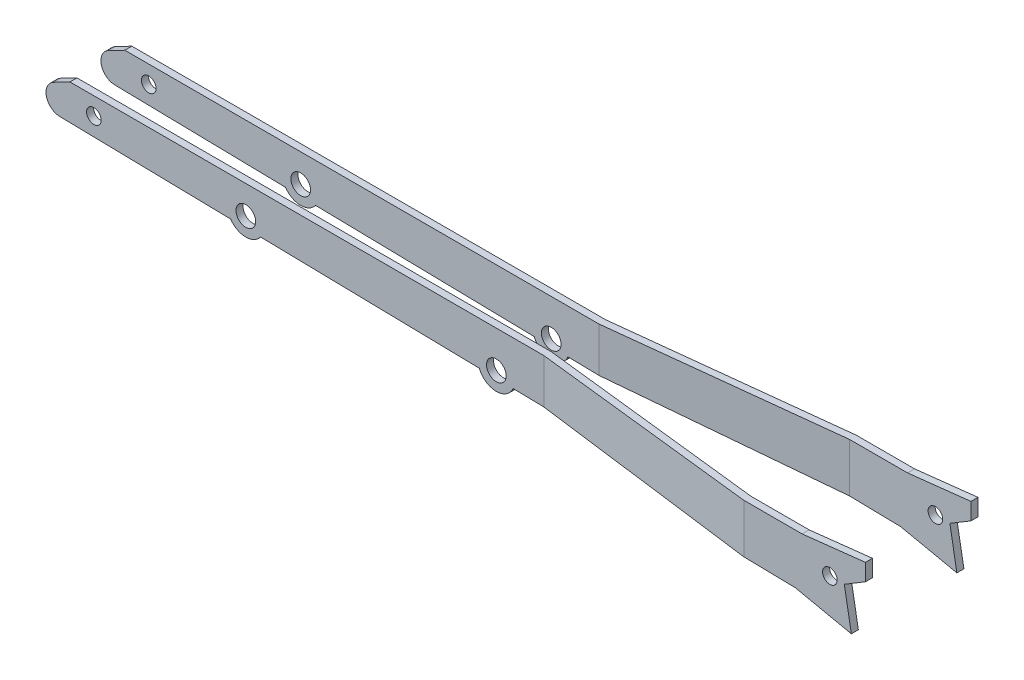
ISO-10303-21;
HEADER;
FILE_DESCRIPTION(('STEP AP214'),'2;1');
FILE_NAME('part.step','',(''),(''),'','','');
FILE_SCHEMA(('AUTOMOTIVE_DESIGN { 1 0 10303 214 1 1 1 1 }'));
ENDSEC;
DATA;
#1=APPLICATION_CONTEXT('core data for automotive mechanical design processes');
#2=APPLICATION_PROTOCOL_DEFINITION('international standard','automotive_design',2000,#1);
#3=PRODUCT_CONTEXT('',#1,'mechanical');
#4=PRODUCT('Part','Part','',(#3));
#5=PRODUCT_RELATED_PRODUCT_CATEGORY('part','',(#4));
#6=PRODUCT_DEFINITION_FORMATION('','',#4);
#7=PRODUCT_DEFINITION_CONTEXT('part definition',#1,'design');
#8=PRODUCT_DEFINITION('design','',#6,#7);
#9=PRODUCT_DEFINITION_SHAPE('','',#8);
#10=(LENGTH_UNIT() NAMED_UNIT(*) SI_UNIT(.MILLI.,.METRE.));
#11=(NAMED_UNIT(*) PLANE_ANGLE_UNIT() SI_UNIT($,.RADIAN.));
#12=(NAMED_UNIT(*) SI_UNIT($,.STERADIAN.) SOLID_ANGLE_UNIT());
#13=UNCERTAINTY_MEASURE_WITH_UNIT(LENGTH_MEASURE(1.E-05),#10,'distance_accuracy_value','');
#14=(GEOMETRIC_REPRESENTATION_CONTEXT(3) GLOBAL_UNCERTAINTY_ASSIGNED_CONTEXT((#13)) GLOBAL_UNIT_ASSIGNED_CONTEXT((#10,
#11,#12)) REPRESENTATION_CONTEXT('',''));
#15=CARTESIAN_POINT('',(0.,0.,0.));
#16=DIRECTION('',(0.,0.,1.));
#17=DIRECTION('',(1.,0.,0.));
#18=AXIS2_PLACEMENT_3D('',#15,#16,#17);
#19=CARTESIAN_POINT('',(240.,-15.75,-26.));
#20=DIRECTION('',(1.,0.,0.));
#21=DIRECTION('',(0.,0.,1.));
#22=AXIS2_PLACEMENT_3D('',#19,#20,#21);
#23=PLANE('',#22);
#24=DIRECTION('',(0.,1.,0.));
#25=VECTOR('',#24,1.);
#26=CARTESIAN_POINT('',(240.,-15.75,-28.5157705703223));
#27=LINE('',#26,#25);
#28=CARTESIAN_POINT('',(240.,-11.1573033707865,-28.5157705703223));
#29=VERTEX_POINT('',#28);
#30=CARTESIAN_POINT('',(240.,6.25,-28.5157705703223));
#31=VERTEX_POINT('',#30);
#32=EDGE_CURVE('E231',#29,#31,#27,.T.);
#33=ORIENTED_EDGE('',*,*,#32,.T.);
#34=DIRECTION('',(0.,0.,1.));
#35=VECTOR('',#34,1.);
#36=CARTESIAN_POINT('',(240.,6.25,-26.));
#37=LINE('',#36,#35);
#38=CARTESIAN_POINT('',(240.,6.25,-28.5));
#39=VERTEX_POINT('',#38);
#40=EDGE_CURVE('E228',#31,#39,#37,.T.);
#41=ORIENTED_EDGE('',*,*,#40,.T.);
#42=DIRECTION('',(0.,1.,0.));
#43=VECTOR('',#42,1.);
#44=CARTESIAN_POINT('',(240.,6.25,-28.5));
#45=LINE('',#44,#43);
#46=CARTESIAN_POINT('',(240.,-11.1573033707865,-28.5));
#47=VERTEX_POINT('',#46);
#48=EDGE_CURVE('E394',#47,#39,#45,.T.);
#49=ORIENTED_EDGE('',*,*,#48,.F.);
#50=DIRECTION('',(0.,0.,-1.));
#51=VECTOR('',#50,1.);
#52=CARTESIAN_POINT('',(240.,-11.1573033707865,-28.5167705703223));
#53=LINE('',#52,#51);
#54=EDGE_CURVE('E410',#47,#29,#53,.T.);
#55=ORIENTED_EDGE('',*,*,#54,.T.);
#56=EDGE_LOOP('',(#33,#41,#49,#55));
#57=FACE_BOUND('',#56,.T.);
#58=ADVANCED_FACE('F43',(#57),#23,.T.);
#59=CARTESIAN_POINT('',(160.,-15.75,-17.));
#60=DIRECTION('',(0.111794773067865,0.,0.993731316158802));
#61=DIRECTION('',(-0.993731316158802,0.,0.111794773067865));
#62=AXIS2_PLACEMENT_3D('',#59,#60,#61);
#63=PLANE('',#62);
#64=DIRECTION('',(0.,1.,0.));
#65=VECTOR('',#64,1.);
#66=CARTESIAN_POINT('',(240.,-15.75,-26.));
#67=LINE('',#66,#65);
#68=CARTESIAN_POINT('',(240.,-11.1573033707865,-26.));
#69=VERTEX_POINT('',#68);
#70=CARTESIAN_POINT('',(240.,6.25,-26.));
#71=VERTEX_POINT('',#70);
#72=EDGE_CURVE('E225',#69,#71,#67,.T.);
#73=ORIENTED_EDGE('',*,*,#72,.T.);
#74=DIRECTION('',(-0.993731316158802,0.,0.111794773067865));
#75=VECTOR('',#74,1.);
#76=CARTESIAN_POINT('',(160.,6.25,-17.));
#77=LINE('',#76,#75);
#78=CARTESIAN_POINT('',(160.,6.25,-17.));
#79=VERTEX_POINT('',#78);
#80=EDGE_CURVE('E223',#71,#79,#77,.T.);
#81=ORIENTED_EDGE('',*,*,#80,.T.);
#82=DIRECTION('',(0.,1.,0.));
#83=VECTOR('',#82,1.);
#84=CARTESIAN_POINT('',(160.,6.25,-17.));
#85=LINE('',#84,#83);
#86=CARTESIAN_POINT('',(160.,-9.58426966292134,-17.));
#87=VERTEX_POINT('',#86);
#88=EDGE_CURVE('E169',#87,#79,#85,.T.);
#89=ORIENTED_EDGE('',*,*,#88,.F.);
#90=DIRECTION('',(-0.993541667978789,0.0195359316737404,0.111773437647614));
#91=VECTOR('',#90,1.);
#92=CARTESIAN_POINT('',(159.86145744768,-9.58154551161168,-16.984413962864));
#93=LINE('',#92,#91);
#94=EDGE_CURVE('E210',#69,#87,#93,.T.);
#95=ORIENTED_EDGE('',*,*,#94,.F.);
#96=EDGE_LOOP('',(#73,#81,#89,#95));
#97=FACE_BOUND('',#96,.T.);
#98=ADVANCED_FACE('F221',(#97),#63,.T.);
#99=CARTESIAN_POINT('',(159.85981715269,-15.75,-19.5));
#100=DIRECTION('',(-0.111794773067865,0.,-0.993731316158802));
#101=DIRECTION('',(0.993731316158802,0.,-0.111794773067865));
#102=AXIS2_PLACEMENT_3D('',#99,#100,#101);
#103=PLANE('',#102);
#104=DIRECTION('',(0.,1.,0.));
#105=VECTOR('',#104,1.);
#106=CARTESIAN_POINT('',(159.85981715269,-15.75,-19.5));
#107=LINE('',#106,#105);
#108=CARTESIAN_POINT('',(159.85981715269,-9.58151325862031,-19.5));
#109=VERTEX_POINT('',#108);
#110=CARTESIAN_POINT('',(159.85981715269,6.25,-19.5));
#111=VERTEX_POINT('',#110);
#112=EDGE_CURVE('E227',#109,#111,#107,.T.);
#113=ORIENTED_EDGE('',*,*,#112,.T.);
#114=DIRECTION('',(0.993731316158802,0.,-0.111794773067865));
#115=VECTOR('',#114,1.);
#116=CARTESIAN_POINT('',(159.85981715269,6.25,-19.5));
#117=LINE('',#116,#115);
#118=EDGE_CURVE('E234',#111,#31,#117,.T.);
#119=ORIENTED_EDGE('',*,*,#118,.T.);
#120=ORIENTED_EDGE('',*,*,#32,.F.);
#121=DIRECTION('',(-0.993541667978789,0.0195359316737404,0.111773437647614));
#122=VECTOR('',#121,1.);
#123=CARTESIAN_POINT('',(160.861143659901,-9.60120226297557,-19.6126492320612));
#124=LINE('',#123,#122);
#125=EDGE_CURVE('E306',#29,#109,#124,.T.);
#126=ORIENTED_EDGE('',*,*,#125,.T.);
#127=EDGE_LOOP('',(#113,#119,#120,#126));
#128=FACE_BOUND('',#127,.T.);
#129=ADVANCED_FACE('F289',(#128),#103,.T.);
#130=CARTESIAN_POINT('',(0.,0.,-26.));
#131=DIRECTION('',(0.,0.,-1.));
#132=DIRECTION('',(1.,0.,0.));
#133=AXIS2_PLACEMENT_3D('',#130,#131,#132);
#134=PLANE('',#133);
#135=CARTESIAN_POINT('',(270.5,-1.75,-26.));
#136=DIRECTION('',(0.,0.,-1.));
#137=DIRECTION('',(-1.,0.,0.));
#138=AXIS2_PLACEMENT_3D('',#135,#136,#137);
#139=CIRCLE('',#138,2.60000000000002);
#140=CARTESIAN_POINT('',(267.9,-1.75,-26.));
#141=VERTEX_POINT('',#140);
#142=EDGE_CURVE('E396',#141,#141,#139,.T.);
#143=ORIENTED_EDGE('',*,*,#142,.T.);
#144=EDGE_LOOP('',(#143));
#145=FACE_BOUND('',#144,.T.);
#146=DIRECTION('',(0.999806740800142,-0.0196591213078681,0.));
#147=VECTOR('',#146,1.);
#148=CARTESIAN_POINT('',(159.85981715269,-9.58151325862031,-26.));
#149=LINE('',#148,#147);
#150=CARTESIAN_POINT('',(258.131253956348,-11.5138167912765,-26.));
#151=VERTEX_POINT('',#150);
#152=EDGE_CURVE('E215',#69,#151,#149,.T.);
#153=ORIENTED_EDGE('',*,*,#152,.T.);
#154=DIRECTION('',(0.978296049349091,-0.207212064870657,0.));
#155=VECTOR('',#154,1.);
#156=CARTESIAN_POINT('',(258.131253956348,-11.5138167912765,-26.));
#157=LINE('',#156,#155);
#158=CARTESIAN_POINT('',(278.131253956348,-15.75,-26.));
#159=VERTEX_POINT('',#158);
#160=EDGE_CURVE('E422',#151,#159,#157,.T.);
#161=ORIENTED_EDGE('',*,*,#160,.T.);
#162=DIRECTION('',(0.175790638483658,-0.984427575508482,0.));
#163=VECTOR('',#162,1.);
#164=CARTESIAN_POINT('',(275.631253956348,-1.75,-26.));
#165=LINE('',#164,#163);
#166=CARTESIAN_POINT('',(275.631253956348,-1.75,-26.));
#167=VERTEX_POINT('',#166);
#168=EDGE_CURVE('E383',#167,#159,#165,.T.);
#169=ORIENTED_EDGE('',*,*,#168,.F.);
#170=DIRECTION('',(-0.857492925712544,-0.514495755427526,0.));
#171=VECTOR('',#170,1.);
#172=CARTESIAN_POINT('',(275.631253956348,-1.75,-26.));
#173=LINE('',#172,#171);
#174=CARTESIAN_POINT('',(283.131253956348,2.75,-26.));
#175=VERTEX_POINT('',#174);
#176=EDGE_CURVE('E360',#175,#167,#173,.T.);
#177=ORIENTED_EDGE('',*,*,#176,.F.);
#178=DIRECTION('',(0.,-1.,0.));
#179=VECTOR('',#178,1.);
#180=CARTESIAN_POINT('',(283.131253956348,8.75,-26.));
#181=LINE('',#180,#179);
#182=CARTESIAN_POINT('',(283.131253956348,8.75,-26.));
#183=VERTEX_POINT('',#182);
#184=EDGE_CURVE('E401',#183,#175,#181,.T.);
#185=ORIENTED_EDGE('',*,*,#184,.F.);
#186=DIRECTION('',(0.993883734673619,0.110431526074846,0.));
#187=VECTOR('',#186,1.);
#188=CARTESIAN_POINT('',(260.631253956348,6.25,-26.));
#189=LINE('',#188,#187);
#190=CARTESIAN_POINT('',(260.631253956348,6.25,-26.));
#191=VERTEX_POINT('',#190);
#192=EDGE_CURVE('E404',#191,#183,#189,.T.);
#193=ORIENTED_EDGE('',*,*,#192,.F.);
#194=DIRECTION('',(1.,0.,0.));
#195=VECTOR('',#194,1.);
#196=CARTESIAN_POINT('',(240.,6.25,-26.));
#197=LINE('',#196,#195);
#198=EDGE_CURVE('E373',#71,#191,#197,.T.);
#199=ORIENTED_EDGE('',*,*,#198,.F.);
#200=ORIENTED_EDGE('',*,*,#72,.F.);
#201=EDGE_LOOP('',(#153,#161,#169,#177,#185,#193,#199,#200));
#202=FACE_BOUND('',#201,.T.);
#203=ADVANCED_FACE('F292',(#145,#202),#134,.F.);
#204=CARTESIAN_POINT('',(0.,0.,-28.5));
#205=DIRECTION('',(0.,0.,-1.));
#206=DIRECTION('',(1.,0.,0.));
#207=AXIS2_PLACEMENT_3D('',#204,#205,#206);
#208=PLANE('',#207);
#209=CARTESIAN_POINT('',(270.5,-1.75,-28.5));
#210=DIRECTION('',(0.,0.,-1.));
#211=DIRECTION('',(-1.,0.,0.));
#212=AXIS2_PLACEMENT_3D('',#209,#210,#211);
#213=CIRCLE('',#212,2.60000000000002);
#214=CARTESIAN_POINT('',(267.9,-1.75,-28.5));
#215=VERTEX_POINT('',#214);
#216=EDGE_CURVE('E407',#215,#215,#213,.T.);
#217=ORIENTED_EDGE('',*,*,#216,.F.);
#218=EDGE_LOOP('',(#217));
#219=FACE_BOUND('',#218,.T.);
#220=ORIENTED_EDGE('',*,*,#48,.T.);
#221=DIRECTION('',(1.,0.,0.));
#222=VECTOR('',#221,1.);
#223=CARTESIAN_POINT('',(240.,6.25,-28.5));
#224=LINE('',#223,#222);
#225=CARTESIAN_POINT('',(260.631253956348,6.25,-28.5));
#226=VERTEX_POINT('',#225);
#227=EDGE_CURVE('E58',#39,#226,#224,.T.);
#228=ORIENTED_EDGE('',*,*,#227,.T.);
#229=DIRECTION('',(0.993883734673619,0.110431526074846,0.));
#230=VECTOR('',#229,1.);
#231=CARTESIAN_POINT('',(260.631253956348,6.25,-28.5));
#232=LINE('',#231,#230);
#233=CARTESIAN_POINT('',(283.131253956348,8.75,-28.5));
#234=VERTEX_POINT('',#233);
#235=EDGE_CURVE('E379',#226,#234,#232,.T.);
#236=ORIENTED_EDGE('',*,*,#235,.T.);
#237=DIRECTION('',(0.,-1.,0.));
#238=VECTOR('',#237,1.);
#239=CARTESIAN_POINT('',(283.131253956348,8.75,-28.5));
#240=LINE('',#239,#238);
#241=CARTESIAN_POINT('',(283.131253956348,2.75,-28.5));
#242=VERTEX_POINT('',#241);
#243=EDGE_CURVE('E377',#234,#242,#240,.T.);
#244=ORIENTED_EDGE('',*,*,#243,.T.);
#245=DIRECTION('',(-0.857492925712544,-0.514495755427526,0.));
#246=VECTOR('',#245,1.);
#247=CARTESIAN_POINT('',(275.631253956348,-1.75,-28.5));
#248=LINE('',#247,#246);
#249=CARTESIAN_POINT('',(275.631253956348,-1.75,-28.5));
#250=VERTEX_POINT('',#249);
#251=EDGE_CURVE('E357',#242,#250,#248,.T.);
#252=ORIENTED_EDGE('',*,*,#251,.T.);
#253=DIRECTION('',(0.175790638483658,-0.984427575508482,0.));
#254=VECTOR('',#253,1.);
#255=CARTESIAN_POINT('',(275.631253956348,-1.75,-28.5));
#256=LINE('',#255,#254);
#257=CARTESIAN_POINT('',(278.131253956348,-15.75,-28.5));
#258=VERTEX_POINT('',#257);
#259=EDGE_CURVE('E368',#250,#258,#256,.T.);
#260=ORIENTED_EDGE('',*,*,#259,.T.);
#261=DIRECTION('',(-0.978296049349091,0.207212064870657,0.));
#262=VECTOR('',#261,1.);
#263=CARTESIAN_POINT('',(258.131253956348,-11.5138167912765,-28.5));
#264=LINE('',#263,#262);
#265=CARTESIAN_POINT('',(258.131253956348,-11.5138167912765,-28.5));
#266=VERTEX_POINT('',#265);
#267=EDGE_CURVE('E219',#258,#266,#264,.T.);
#268=ORIENTED_EDGE('',*,*,#267,.T.);
#269=DIRECTION('',(-0.999806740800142,0.0196591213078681,0.));
#270=VECTOR('',#269,1.);
#271=CARTESIAN_POINT('',(159.85981715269,-9.58151325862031,-28.5));
#272=LINE('',#271,#270);
#273=EDGE_CURVE('E418',#266,#47,#272,.T.);
#274=ORIENTED_EDGE('',*,*,#273,.T.);
#275=EDGE_LOOP('',(#220,#228,#236,#244,#252,#260,#268,#274));
#276=FACE_BOUND('',#275,.T.);
#277=ADVANCED_FACE('F297',(#219,#276),#208,.T.);
#278=CARTESIAN_POINT('',(-12.,-1.20128070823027,-19.5));
#279=DIRECTION('',(0.,0.,-1.));
#280=DIRECTION('',(1.,0.,0.));
#281=AXIS2_PLACEMENT_3D('',#278,#279,#280);
#282=PLANE('',#281);
#283=ORIENTED_EDGE('',*,*,#112,.F.);
#284=DIRECTION('',(0.999806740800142,-0.0196591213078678,0.));
#285=VECTOR('',#284,1.);
#286=CARTESIAN_POINT('',(148.949903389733,-9.36699248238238,-19.5));
#287=LINE('',#286,#285);
#288=CARTESIAN_POINT('',(148.949903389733,-9.36699248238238,-19.5));
#289=VERTEX_POINT('',#288);
#290=EDGE_CURVE('E143',#289,#109,#287,.T.);
#291=ORIENTED_EDGE('',*,*,#290,.F.);
#292=CARTESIAN_POINT('',(143.,-6.75,-19.5));
#293=DIRECTION('',(0.,0.,1.));
#294=DIRECTION('',(1.,0.,0.));
#295=AXIS2_PLACEMENT_3D('',#292,#293,#294);
#296=CIRCLE('',#295,6.50000000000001);
#297=CARTESIAN_POINT('',(136.951820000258,-9.13107511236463,-19.5));
#298=VERTEX_POINT('',#297);
#299=EDGE_CURVE('E121',#298,#289,#296,.T.);
#300=ORIENTED_EDGE('',*,*,#299,.F.);
#301=DIRECTION('',(0.999806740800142,-0.0196591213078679,0.));
#302=VECTOR('',#301,1.);
#303=CARTESIAN_POINT('',(59.2349683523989,-7.60293477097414,-19.5));
#304=LINE('',#303,#302);
#305=CARTESIAN_POINT('',(59.2349683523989,-7.60293477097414,-19.5));
#306=VERTEX_POINT('',#305);
#307=EDGE_CURVE('E132',#306,#298,#304,.T.);
#308=ORIENTED_EDGE('',*,*,#307,.F.);
#309=CARTESIAN_POINT('',(54.,-3.75,-19.5));
#310=DIRECTION('',(0.,0.,1.));
#311=DIRECTION('',(1.,0.,0.));
#312=AXIS2_PLACEMENT_3D('',#309,#310,#311);
#313=CIRCLE('',#312,6.5);
#314=CARTESIAN_POINT('',(48.6176167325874,-7.39416662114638,-19.5));
#315=VERTEX_POINT('',#314);
#316=EDGE_CURVE('E137',#315,#306,#313,.T.);
#317=ORIENTED_EDGE('',*,*,#316,.F.);
#318=DIRECTION('',(0.999806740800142,-0.0196591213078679,0.));
#319=VECTOR('',#318,1.);
#320=CARTESIAN_POINT('',(48.6176167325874,-7.39416662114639,-19.5));
#321=LINE('',#320,#319);
#322=CARTESIAN_POINT('',(-12.0982956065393,-6.20031441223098,-19.5));
#323=VERTEX_POINT('',#322);
#324=EDGE_CURVE('E194',#323,#315,#321,.T.);
#325=ORIENTED_EDGE('',*,*,#324,.F.);
#326=CARTESIAN_POINT('',(-12.,-1.20128070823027,-19.5));
#327=DIRECTION('',(0.,0.,1.));
#328=DIRECTION('',(1.,0.,0.));
#329=AXIS2_PLACEMENT_3D('',#326,#327,#328);
#330=CIRCLE('',#329,5.);
#331=CARTESIAN_POINT('',(-14.3041638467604,3.23615424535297,-19.5));
#332=VERTEX_POINT('',#331);
#333=EDGE_CURVE('E182',#332,#323,#330,.T.);
#334=ORIENTED_EDGE('',*,*,#333,.F.);
#335=DIRECTION('',(-0.887486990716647,-0.460832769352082,0.));
#336=VECTOR('',#335,1.);
#337=CARTESIAN_POINT('',(-8.5,6.25,-19.5));
#338=LINE('',#337,#336);
#339=CARTESIAN_POINT('',(-8.5,6.25,-19.5));
#340=VERTEX_POINT('',#339);
#341=EDGE_CURVE('E174',#340,#332,#338,.T.);
#342=ORIENTED_EDGE('',*,*,#341,.F.);
#343=DIRECTION('',(-1.,0.,0.));
#344=VECTOR('',#343,1.);
#345=CARTESIAN_POINT('',(-8.5,6.25,-19.5));
#346=LINE('',#345,#344);
#347=EDGE_CURVE('E145',#111,#340,#346,.T.);
#348=ORIENTED_EDGE('',*,*,#347,.F.);
#349=EDGE_LOOP('',(#283,#291,#300,#308,#317,#325,#334,#342,#348));
#350=FACE_BOUND('',#349,.T.);
#351=CARTESIAN_POINT('',(54.,-3.75,-19.5));
#352=DIRECTION('',(0.,0.,1.));
#353=DIRECTION('',(1.,0.,0.));
#354=AXIS2_PLACEMENT_3D('',#351,#352,#353);
#355=CIRCLE('',#354,3.5);
#356=CARTESIAN_POINT('',(57.5,-3.75,-19.5));
#357=VERTEX_POINT('',#356);
#358=EDGE_CURVE('E248',#357,#357,#355,.T.);
#359=ORIENTED_EDGE('',*,*,#358,.T.);
#360=EDGE_LOOP('',(#359));
#361=FACE_BOUND('',#360,.T.);
#362=CARTESIAN_POINT('',(0.,0.,-19.5));
#363=DIRECTION('',(0.,0.,1.));
#364=DIRECTION('',(1.,0.,0.));
#365=AXIS2_PLACEMENT_3D('',#362,#363,#364);
#366=CIRCLE('',#365,2.6);
#367=CARTESIAN_POINT('',(2.6,0.,-19.5));
#368=VERTEX_POINT('',#367);
#369=EDGE_CURVE('E154',#368,#368,#366,.T.);
#370=ORIENTED_EDGE('',*,*,#369,.T.);
#371=EDGE_LOOP('',(#370));
#372=FACE_BOUND('',#371,.T.);
#373=CARTESIAN_POINT('',(143.,-6.75,-19.5));
#374=DIRECTION('',(0.,0.,1.));
#375=DIRECTION('',(1.,0.,0.));
#376=AXIS2_PLACEMENT_3D('',#373,#374,#375);
#377=CIRCLE('',#376,3.49999999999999);
#378=CARTESIAN_POINT('',(146.5,-6.75,-19.5));
#379=VERTEX_POINT('',#378);
#380=EDGE_CURVE('E242',#379,#379,#377,.T.);
#381=ORIENTED_EDGE('',*,*,#380,.T.);
#382=EDGE_LOOP('',(#381));
#383=FACE_BOUND('',#382,.T.);
#384=ADVANCED_FACE('F140',(#350,#361,#372,#383),#282,.T.);
#385=CARTESIAN_POINT('',(-12.,-1.20128070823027,-17.));
#386=DIRECTION('',(0.,0.,-1.));
#387=DIRECTION('',(1.,0.,0.));
#388=AXIS2_PLACEMENT_3D('',#385,#386,#387);
#389=PLANE('',#388);
#390=DIRECTION('',(-0.887486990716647,-0.460832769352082,0.));
#391=VECTOR('',#390,1.);
#392=CARTESIAN_POINT('',(-8.5,6.25,-17.));
#393=LINE('',#392,#391);
#394=CARTESIAN_POINT('',(-8.5,6.25,-17.));
#395=VERTEX_POINT('',#394);
#396=CARTESIAN_POINT('',(-14.3041638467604,3.23615424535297,-17.));
#397=VERTEX_POINT('',#396);
#398=EDGE_CURVE('E150',#395,#397,#393,.T.);
#399=ORIENTED_EDGE('',*,*,#398,.T.);
#400=CARTESIAN_POINT('',(-12.,-1.20128070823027,-17.));
#401=DIRECTION('',(0.,0.,1.));
#402=DIRECTION('',(1.,0.,0.));
#403=AXIS2_PLACEMENT_3D('',#400,#401,#402);
#404=CIRCLE('',#403,5.);
#405=CARTESIAN_POINT('',(-12.0982956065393,-6.20031441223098,-17.));
#406=VERTEX_POINT('',#405);
#407=EDGE_CURVE('E153',#397,#406,#404,.T.);
#408=ORIENTED_EDGE('',*,*,#407,.T.);
#409=DIRECTION('',(0.999806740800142,-0.0196591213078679,0.));
#410=VECTOR('',#409,1.);
#411=CARTESIAN_POINT('',(48.6176167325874,-7.39416662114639,-17.));
#412=LINE('',#411,#410);
#413=CARTESIAN_POINT('',(48.6176167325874,-7.39416662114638,-17.));
#414=VERTEX_POINT('',#413);
#415=EDGE_CURVE('E157',#406,#414,#412,.T.);
#416=ORIENTED_EDGE('',*,*,#415,.T.);
#417=CARTESIAN_POINT('',(54.,-3.75,-17.));
#418=DIRECTION('',(0.,0.,1.));
#419=DIRECTION('',(1.,0.,0.));
#420=AXIS2_PLACEMENT_3D('',#417,#418,#419);
#421=CIRCLE('',#420,6.5);
#422=CARTESIAN_POINT('',(59.2349683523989,-7.60293477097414,-17.));
#423=VERTEX_POINT('',#422);
#424=EDGE_CURVE('E160',#414,#423,#421,.T.);
#425=ORIENTED_EDGE('',*,*,#424,.T.);
#426=DIRECTION('',(0.999806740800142,-0.0196591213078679,0.));
#427=VECTOR('',#426,1.);
#428=CARTESIAN_POINT('',(59.2349683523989,-7.60293477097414,-17.));
#429=LINE('',#428,#427);
#430=CARTESIAN_POINT('',(136.951820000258,-9.13107511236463,-17.));
#431=VERTEX_POINT('',#430);
#432=EDGE_CURVE('E163',#423,#431,#429,.T.);
#433=ORIENTED_EDGE('',*,*,#432,.T.);
#434=CARTESIAN_POINT('',(143.,-6.75,-17.));
#435=DIRECTION('',(0.,0.,1.));
#436=DIRECTION('',(1.,0.,0.));
#437=AXIS2_PLACEMENT_3D('',#434,#435,#436);
#438=CIRCLE('',#437,6.50000000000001);
#439=CARTESIAN_POINT('',(148.949903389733,-9.36699248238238,-17.));
#440=VERTEX_POINT('',#439);
#441=EDGE_CURVE('E124',#431,#440,#438,.T.);
#442=ORIENTED_EDGE('',*,*,#441,.T.);
#443=DIRECTION('',(0.999806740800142,-0.0196591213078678,0.));
#444=VECTOR('',#443,1.);
#445=CARTESIAN_POINT('',(148.949903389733,-9.36699248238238,-17.));
#446=LINE('',#445,#444);
#447=EDGE_CURVE('E166',#440,#87,#446,.T.);
#448=ORIENTED_EDGE('',*,*,#447,.T.);
#449=ORIENTED_EDGE('',*,*,#88,.T.);
#450=DIRECTION('',(-1.,0.,0.));
#451=VECTOR('',#450,1.);
#452=CARTESIAN_POINT('',(-8.5,6.25,-17.));
#453=LINE('',#452,#451);
#454=EDGE_CURVE('E172',#79,#395,#453,.T.);
#455=ORIENTED_EDGE('',*,*,#454,.T.);
#456=EDGE_LOOP('',(#399,#408,#416,#425,#433,#442,#448,#449,#455));
#457=FACE_BOUND('',#456,.T.);
#458=CARTESIAN_POINT('',(0.,0.,-17.));
#459=DIRECTION('',(0.,0.,1.));
#460=DIRECTION('',(1.,0.,0.));
#461=AXIS2_PLACEMENT_3D('',#458,#459,#460);
#462=CIRCLE('',#461,2.6);
#463=CARTESIAN_POINT('',(2.6,0.,-17.));
#464=VERTEX_POINT('',#463);
#465=EDGE_CURVE('E251',#464,#464,#462,.T.);
#466=ORIENTED_EDGE('',*,*,#465,.F.);
#467=EDGE_LOOP('',(#466));
#468=FACE_BOUND('',#467,.T.);
#469=CARTESIAN_POINT('',(54.,-3.75,-17.));
#470=DIRECTION('',(0.,0.,1.));
#471=DIRECTION('',(1.,0.,0.));
#472=AXIS2_PLACEMENT_3D('',#469,#470,#471);
#473=CIRCLE('',#472,3.5);
#474=CARTESIAN_POINT('',(57.5,-3.75,-17.));
#475=VERTEX_POINT('',#474);
#476=EDGE_CURVE('E245',#475,#475,#473,.T.);
#477=ORIENTED_EDGE('',*,*,#476,.F.);
#478=EDGE_LOOP('',(#477));
#479=FACE_BOUND('',#478,.T.);
#480=CARTESIAN_POINT('',(143.,-6.75,-17.));
#481=DIRECTION('',(0.,0.,1.));
#482=DIRECTION('',(1.,0.,0.));
#483=AXIS2_PLACEMENT_3D('',#480,#481,#482);
#484=CIRCLE('',#483,3.49999999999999);
#485=CARTESIAN_POINT('',(146.5,-6.75,-17.));
#486=VERTEX_POINT('',#485);
#487=EDGE_CURVE('E239',#486,#486,#484,.T.);
#488=ORIENTED_EDGE('',*,*,#487,.F.);
#489=EDGE_LOOP('',(#488));
#490=FACE_BOUND('',#489,.T.);
#491=ADVANCED_FACE('F189',(#457,#468,#479,#490),#389,.F.);
#492=CARTESIAN_POINT('',(-8.5,6.25,-19.5));
#493=DIRECTION('',(0.460832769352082,-0.887486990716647,0.));
#494=DIRECTION('',(0.887486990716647,0.460832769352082,0.));
#495=AXIS2_PLACEMENT_3D('',#492,#493,#494);
#496=PLANE('',#495);
#497=ORIENTED_EDGE('',*,*,#398,.F.);
#498=DIRECTION('',(0.,0.,1.));
#499=VECTOR('',#498,1.);
#500=CARTESIAN_POINT('',(-8.5,6.25,-19.5));
#501=LINE('',#500,#499);
#502=EDGE_CURVE('E67',#340,#395,#501,.T.);
#503=ORIENTED_EDGE('',*,*,#502,.F.);
#504=ORIENTED_EDGE('',*,*,#341,.T.);
#505=DIRECTION('',(0.,0.,1.));
#506=VECTOR('',#505,1.);
#507=CARTESIAN_POINT('',(-14.3041638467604,3.23615424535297,-19.5));
#508=LINE('',#507,#506);
#509=EDGE_CURVE('E12',#332,#397,#508,.T.);
#510=ORIENTED_EDGE('',*,*,#509,.T.);
#511=EDGE_LOOP('',(#497,#503,#504,#510));
#512=FACE_BOUND('',#511,.T.);
#513=ADVANCED_FACE('F45',(#512),#496,.F.);
#514=CARTESIAN_POINT('',(-12.,-1.20128070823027,-19.5));
#515=DIRECTION('',(0.,0.,1.));
#516=DIRECTION('',(-1.,0.,0.));
#517=AXIS2_PLACEMENT_3D('',#514,#515,#516);
#518=CYLINDRICAL_SURFACE('',#517,5.);
#519=ORIENTED_EDGE('',*,*,#407,.F.);
#520=ORIENTED_EDGE('',*,*,#509,.F.);
#521=ORIENTED_EDGE('',*,*,#333,.T.);
#522=DIRECTION('',(0.,0.,1.));
#523=VECTOR('',#522,1.);
#524=CARTESIAN_POINT('',(-12.0982956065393,-6.20031441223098,-19.5));
#525=LINE('',#524,#523);
#526=EDGE_CURVE('E51',#323,#406,#525,.T.);
#527=ORIENTED_EDGE('',*,*,#526,.T.);
#528=EDGE_LOOP('',(#519,#520,#521,#527));
#529=FACE_BOUND('',#528,.T.);
#530=ADVANCED_FACE('F180',(#529),#518,.T.);
#531=CARTESIAN_POINT('',(48.6176167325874,-7.39416662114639,-19.5));
#532=DIRECTION('',(0.0196591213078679,0.999806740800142,0.));
#533=DIRECTION('',(-0.999806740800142,0.0196591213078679,0.));
#534=AXIS2_PLACEMENT_3D('',#531,#532,#533);
#535=PLANE('',#534);
#536=ORIENTED_EDGE('',*,*,#415,.F.);
#537=ORIENTED_EDGE('',*,*,#526,.F.);
#538=ORIENTED_EDGE('',*,*,#324,.T.);
#539=DIRECTION('',(0.,0.,1.));
#540=VECTOR('',#539,1.);
#541=CARTESIAN_POINT('',(48.6176167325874,-7.39416662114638,-19.5));
#542=LINE('',#541,#540);
#543=EDGE_CURVE('E178',#315,#414,#542,.T.);
#544=ORIENTED_EDGE('',*,*,#543,.T.);
#545=EDGE_LOOP('',(#536,#537,#538,#544));
#546=FACE_BOUND('',#545,.T.);
#547=ADVANCED_FACE('F186',(#546),#535,.F.);
#548=CARTESIAN_POINT('',(54.,-3.75,-19.5));
#549=DIRECTION('',(0.,0.,1.));
#550=DIRECTION('',(-1.,0.,0.));
#551=AXIS2_PLACEMENT_3D('',#548,#549,#550);
#552=CYLINDRICAL_SURFACE('',#551,6.5);
#553=ORIENTED_EDGE('',*,*,#424,.F.);
#554=ORIENTED_EDGE('',*,*,#543,.F.);
#555=ORIENTED_EDGE('',*,*,#316,.T.);
#556=DIRECTION('',(0.,0.,1.));
#557=VECTOR('',#556,1.);
#558=CARTESIAN_POINT('',(59.2349683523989,-7.60293477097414,-19.5));
#559=LINE('',#558,#557);
#560=EDGE_CURVE('E128',#306,#423,#559,.T.);
#561=ORIENTED_EDGE('',*,*,#560,.T.);
#562=EDGE_LOOP('',(#553,#554,#555,#561));
#563=FACE_BOUND('',#562,.T.);
#564=ADVANCED_FACE('F199',(#563),#552,.T.);
#565=CARTESIAN_POINT('',(59.2349683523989,-7.60293477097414,-19.5));
#566=DIRECTION('',(0.0196591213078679,0.999806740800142,0.));
#567=DIRECTION('',(-0.999806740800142,0.0196591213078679,0.));
#568=AXIS2_PLACEMENT_3D('',#565,#566,#567);
#569=PLANE('',#568);
#570=ORIENTED_EDGE('',*,*,#432,.F.);
#571=ORIENTED_EDGE('',*,*,#560,.F.);
#572=ORIENTED_EDGE('',*,*,#307,.T.);
#573=DIRECTION('',(0.,0.,1.));
#574=VECTOR('',#573,1.);
#575=CARTESIAN_POINT('',(136.951820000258,-9.13107511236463,-19.5));
#576=LINE('',#575,#574);
#577=EDGE_CURVE('E117',#298,#431,#576,.T.);
#578=ORIENTED_EDGE('',*,*,#577,.T.);
#579=EDGE_LOOP('',(#570,#571,#572,#578));
#580=FACE_BOUND('',#579,.T.);
#581=ADVANCED_FACE('F133',(#580),#569,.F.);
#582=CARTESIAN_POINT('',(143.,-6.75,-19.5));
#583=DIRECTION('',(0.,0.,1.));
#584=DIRECTION('',(-1.,0.,0.));
#585=AXIS2_PLACEMENT_3D('',#582,#583,#584);
#586=CYLINDRICAL_SURFACE('',#585,6.50000000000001);
#587=ORIENTED_EDGE('',*,*,#441,.F.);
#588=ORIENTED_EDGE('',*,*,#577,.F.);
#589=ORIENTED_EDGE('',*,*,#299,.T.);
#590=DIRECTION('',(0.,0.,1.));
#591=VECTOR('',#590,1.);
#592=CARTESIAN_POINT('',(148.949903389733,-9.36699248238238,-19.5));
#593=LINE('',#592,#591);
#594=EDGE_CURVE('E129',#289,#440,#593,.T.);
#595=ORIENTED_EDGE('',*,*,#594,.T.);
#596=EDGE_LOOP('',(#587,#588,#589,#595));
#597=FACE_BOUND('',#596,.T.);
#598=ADVANCED_FACE('F119',(#597),#586,.T.);
#599=CARTESIAN_POINT('',(148.949903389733,-9.36699248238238,-19.5));
#600=DIRECTION('',(0.0196591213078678,0.999806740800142,0.));
#601=DIRECTION('',(-0.999806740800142,0.0196591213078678,0.));
#602=AXIS2_PLACEMENT_3D('',#599,#600,#601);
#603=PLANE('',#602);
#604=ORIENTED_EDGE('',*,*,#447,.F.);
#605=ORIENTED_EDGE('',*,*,#594,.F.);
#606=ORIENTED_EDGE('',*,*,#290,.T.);
#607=ORIENTED_EDGE('',*,*,#125,.F.);
#608=ORIENTED_EDGE('',*,*,#54,.F.);
#609=ORIENTED_EDGE('',*,*,#273,.F.);
#610=DIRECTION('',(0.,0.,-1.));
#611=VECTOR('',#610,1.);
#612=CARTESIAN_POINT('',(258.131253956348,-11.5138167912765,-16.999));
#613=LINE('',#612,#611);
#614=EDGE_CURVE('E416',#151,#266,#613,.T.);
#615=ORIENTED_EDGE('',*,*,#614,.F.);
#616=ORIENTED_EDGE('',*,*,#152,.F.);
#617=ORIENTED_EDGE('',*,*,#94,.T.);
#618=EDGE_LOOP('',(#604,#605,#606,#607,#608,#609,#615,#616,#617));
#619=FACE_BOUND('',#618,.T.);
#620=ADVANCED_FACE('F211',(#619),#603,.F.);
#621=CARTESIAN_POINT('',(-8.5,6.25,-19.5));
#622=DIRECTION('',(0.,-1.,0.));
#623=DIRECTION('',(0.,0.,1.));
#624=AXIS2_PLACEMENT_3D('',#621,#622,#623);
#625=PLANE('',#624);
#626=ORIENTED_EDGE('',*,*,#347,.T.);
#627=ORIENTED_EDGE('',*,*,#502,.T.);
#628=ORIENTED_EDGE('',*,*,#454,.F.);
#629=ORIENTED_EDGE('',*,*,#80,.F.);
#630=ORIENTED_EDGE('',*,*,#198,.T.);
#631=DIRECTION('',(0.,0.,-1.));
#632=VECTOR('',#631,1.);
#633=CARTESIAN_POINT('',(260.631253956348,6.25,-26.));
#634=LINE('',#633,#632);
#635=EDGE_CURVE('E388',#191,#226,#634,.T.);
#636=ORIENTED_EDGE('',*,*,#635,.T.);
#637=ORIENTED_EDGE('',*,*,#227,.F.);
#638=ORIENTED_EDGE('',*,*,#40,.F.);
#639=ORIENTED_EDGE('',*,*,#118,.F.);
#640=EDGE_LOOP('',(#626,#627,#628,#629,#630,#636,#637,#638,#639));
#641=FACE_BOUND('',#640,.T.);
#642=ADVANCED_FACE('F390',(#641),#625,.F.);
#643=CARTESIAN_POINT('',(0.,0.,-19.5));
#644=DIRECTION('',(0.,0.,1.));
#645=DIRECTION('',(-1.,0.,0.));
#646=AXIS2_PLACEMENT_3D('',#643,#644,#645);
#647=CYLINDRICAL_SURFACE('',#646,2.6);
#648=ORIENTED_EDGE('',*,*,#369,.F.);
#649=EDGE_LOOP('',(#648));
#650=FACE_BOUND('',#649,.T.);
#651=ORIENTED_EDGE('',*,*,#465,.T.);
#652=EDGE_LOOP('',(#651));
#653=FACE_BOUND('',#652,.T.);
#654=ADVANCED_FACE('F258',(#650,#653),#647,.F.);
#655=CARTESIAN_POINT('',(54.,-3.75,-19.5));
#656=DIRECTION('',(0.,0.,1.));
#657=DIRECTION('',(-1.,0.,0.));
#658=AXIS2_PLACEMENT_3D('',#655,#656,#657);
#659=CYLINDRICAL_SURFACE('',#658,3.5);
#660=ORIENTED_EDGE('',*,*,#358,.F.);
#661=EDGE_LOOP('',(#660));
#662=FACE_BOUND('',#661,.T.);
#663=ORIENTED_EDGE('',*,*,#476,.T.);
#664=EDGE_LOOP('',(#663));
#665=FACE_BOUND('',#664,.T.);
#666=ADVANCED_FACE('F269',(#662,#665),#659,.F.);
#667=CARTESIAN_POINT('',(143.,-6.75,-19.5));
#668=DIRECTION('',(0.,0.,1.));
#669=DIRECTION('',(-1.,0.,0.));
#670=AXIS2_PLACEMENT_3D('',#667,#668,#669);
#671=CYLINDRICAL_SURFACE('',#670,3.49999999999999);
#672=ORIENTED_EDGE('',*,*,#380,.F.);
#673=EDGE_LOOP('',(#672));
#674=FACE_BOUND('',#673,.T.);
#675=ORIENTED_EDGE('',*,*,#487,.T.);
#676=EDGE_LOOP('',(#675));
#677=FACE_BOUND('',#676,.T.);
#678=ADVANCED_FACE('F266',(#674,#677),#671,.F.);
#679=CARTESIAN_POINT('',(260.631253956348,6.25,-26.));
#680=DIRECTION('',(0.110431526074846,-0.993883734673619,0.));
#681=DIRECTION('',(0.993883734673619,0.110431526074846,0.));
#682=AXIS2_PLACEMENT_3D('',#679,#680,#681);
#683=PLANE('',#682);
#684=ORIENTED_EDGE('',*,*,#235,.F.);
#685=ORIENTED_EDGE('',*,*,#635,.F.);
#686=ORIENTED_EDGE('',*,*,#192,.T.);
#687=DIRECTION('',(0.,0.,-1.));
#688=VECTOR('',#687,1.);
#689=CARTESIAN_POINT('',(283.131253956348,8.75,-26.));
#690=LINE('',#689,#688);
#691=EDGE_CURVE('E386',#183,#234,#690,.T.);
#692=ORIENTED_EDGE('',*,*,#691,.T.);
#693=EDGE_LOOP('',(#684,#685,#686,#692));
#694=FACE_BOUND('',#693,.T.);
#695=ADVANCED_FACE('F268',(#694),#683,.F.);
#696=CARTESIAN_POINT('',(283.131253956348,8.75,-26.));
#697=DIRECTION('',(-1.,0.,0.));
#698=DIRECTION('',(0.,0.,-1.));
#699=AXIS2_PLACEMENT_3D('',#696,#697,#698);
#700=PLANE('',#699);
#701=ORIENTED_EDGE('',*,*,#243,.F.);
#702=ORIENTED_EDGE('',*,*,#691,.F.);
#703=ORIENTED_EDGE('',*,*,#184,.T.);
#704=DIRECTION('',(0.,0.,-1.));
#705=VECTOR('',#704,1.);
#706=CARTESIAN_POINT('',(283.131253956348,2.75,-26.));
#707=LINE('',#706,#705);
#708=EDGE_CURVE('E364',#175,#242,#707,.T.);
#709=ORIENTED_EDGE('',*,*,#708,.T.);
#710=EDGE_LOOP('',(#701,#702,#703,#709));
#711=FACE_BOUND('',#710,.T.);
#712=ADVANCED_FACE('F276',(#711),#700,.F.);
#713=CARTESIAN_POINT('',(275.631253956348,-1.75,-26.));
#714=DIRECTION('',(-0.514495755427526,0.857492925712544,0.));
#715=DIRECTION('',(-0.857492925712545,-0.514495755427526,0.));
#716=AXIS2_PLACEMENT_3D('',#713,#714,#715);
#717=PLANE('',#716);
#718=ORIENTED_EDGE('',*,*,#251,.F.);
#719=ORIENTED_EDGE('',*,*,#708,.F.);
#720=ORIENTED_EDGE('',*,*,#176,.T.);
#721=DIRECTION('',(0.,0.,-1.));
#722=VECTOR('',#721,1.);
#723=CARTESIAN_POINT('',(275.631253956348,-1.75,-26.));
#724=LINE('',#723,#722);
#725=EDGE_CURVE('E353',#167,#250,#724,.T.);
#726=ORIENTED_EDGE('',*,*,#725,.T.);
#727=EDGE_LOOP('',(#718,#719,#720,#726));
#728=FACE_BOUND('',#727,.T.);
#729=ADVANCED_FACE('F355',(#728),#717,.F.);
#730=CARTESIAN_POINT('',(275.631253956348,-1.75,-26.));
#731=DIRECTION('',(-0.984427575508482,-0.175790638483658,0.));
#732=DIRECTION('',(0.175790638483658,-0.984427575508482,0.));
#733=AXIS2_PLACEMENT_3D('',#730,#731,#732);
#734=PLANE('',#733);
#735=ORIENTED_EDGE('',*,*,#259,.F.);
#736=ORIENTED_EDGE('',*,*,#725,.F.);
#737=ORIENTED_EDGE('',*,*,#168,.T.);
#738=DIRECTION('',(0.,0.,-1.));
#739=VECTOR('',#738,1.);
#740=CARTESIAN_POINT('',(278.131253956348,-15.75,-26.));
#741=LINE('',#740,#739);
#742=EDGE_CURVE('E365',#159,#258,#741,.T.);
#743=ORIENTED_EDGE('',*,*,#742,.T.);
#744=EDGE_LOOP('',(#735,#736,#737,#743));
#745=FACE_BOUND('',#744,.T.);
#746=ADVANCED_FACE('F369',(#745),#734,.F.);
#747=CARTESIAN_POINT('',(270.5,-1.75,-26.));
#748=DIRECTION('',(0.,0.,-1.));
#749=DIRECTION('',(1.,0.,0.));
#750=AXIS2_PLACEMENT_3D('',#747,#748,#749);
#751=CYLINDRICAL_SURFACE('',#750,2.60000000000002);
#752=ORIENTED_EDGE('',*,*,#142,.F.);
#753=EDGE_LOOP('',(#752));
#754=FACE_BOUND('',#753,.T.);
#755=ORIENTED_EDGE('',*,*,#216,.T.);
#756=EDGE_LOOP('',(#755));
#757=FACE_BOUND('',#756,.T.);
#758=ADVANCED_FACE('F431',(#754,#757),#751,.F.);
#759=CARTESIAN_POINT('',(258.131253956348,-11.5138167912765,-16.999));
#760=DIRECTION('',(0.207212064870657,0.978296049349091,0.));
#761=DIRECTION('',(-0.978296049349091,0.207212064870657,0.));
#762=AXIS2_PLACEMENT_3D('',#759,#760,#761);
#763=PLANE('',#762);
#764=ORIENTED_EDGE('',*,*,#160,.F.);
#765=ORIENTED_EDGE('',*,*,#614,.T.);
#766=ORIENTED_EDGE('',*,*,#267,.F.);
#767=ORIENTED_EDGE('',*,*,#742,.F.);
#768=EDGE_LOOP('',(#764,#765,#766,#767));
#769=FACE_BOUND('',#768,.T.);
#770=ADVANCED_FACE('F427',(#769),#763,.F.);
#771=CLOSED_SHELL('',(#58,#98,#129,#203,#277,#384,#491,#513,#530,#547,#564,#581,#598,#620,#642,
#654,#666,#678,#695,#712,#729,#746,#758,#770));
#772=MANIFOLD_SOLID_BREP('B2',#771);
#773=CARTESIAN_POINT('',(240.,-15.75,9.));
#774=DIRECTION('',(1.,0.,0.));
#775=DIRECTION('',(0.,0.,-1.));
#776=AXIS2_PLACEMENT_3D('',#773,#774,#775);
#777=PLANE('',#776);
#778=DIRECTION('',(0.,1.,0.));
#779=VECTOR('',#778,1.);
#780=CARTESIAN_POINT('',(240.,-15.75,11.5157705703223));
#781=LINE('',#780,#779);
#782=CARTESIAN_POINT('',(240.,-11.1573033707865,11.5157705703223));
#783=VERTEX_POINT('',#782);
#784=CARTESIAN_POINT('',(240.,6.25,11.5157705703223));
#785=VERTEX_POINT('',#784);
#786=EDGE_CURVE('E799',#783,#785,#781,.T.);
#787=ORIENTED_EDGE('',*,*,#786,.F.);
#788=DIRECTION('',(0.,0.,1.));
#789=VECTOR('',#788,1.);
#790=CARTESIAN_POINT('',(240.,-11.1573033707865,11.5167705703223));
#791=LINE('',#790,#789);
#792=CARTESIAN_POINT('',(240.,-11.1573033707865,11.5));
#793=VERTEX_POINT('',#792);
#794=EDGE_CURVE('E862',#793,#783,#791,.T.);
#795=ORIENTED_EDGE('',*,*,#794,.F.);
#796=DIRECTION('',(0.,1.,0.));
#797=VECTOR('',#796,1.);
#798=CARTESIAN_POINT('',(240.,6.25,11.5));
#799=LINE('',#798,#797);
#800=CARTESIAN_POINT('',(240.,6.25,11.5));
#801=VERTEX_POINT('',#800);
#802=EDGE_CURVE('E639',#793,#801,#799,.T.);
#803=ORIENTED_EDGE('',*,*,#802,.T.);
#804=DIRECTION('',(0.,0.,-1.));
#805=VECTOR('',#804,1.);
#806=CARTESIAN_POINT('',(240.,6.25,9.));
#807=LINE('',#806,#805);
#808=EDGE_CURVE('E806',#785,#801,#807,.T.);
#809=ORIENTED_EDGE('',*,*,#808,.F.);
#810=EDGE_LOOP('',(#787,#795,#803,#809));
#811=FACE_BOUND('',#810,.T.);
#812=ADVANCED_FACE('F624',(#811),#777,.T.);
#813=CARTESIAN_POINT('',(160.,-15.75,0.));
#814=DIRECTION('',(0.111794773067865,0.,-0.993731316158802));
#815=DIRECTION('',(-0.993731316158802,0.,-0.111794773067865));
#816=AXIS2_PLACEMENT_3D('',#813,#814,#815);
#817=PLANE('',#816);
#818=DIRECTION('',(0.,1.,0.));
#819=VECTOR('',#818,1.);
#820=CARTESIAN_POINT('',(240.,-15.75,9.));
#821=LINE('',#820,#819);
#822=CARTESIAN_POINT('',(240.,-11.1573033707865,9.));
#823=VERTEX_POINT('',#822);
#824=CARTESIAN_POINT('',(240.,6.25,9.));
#825=VERTEX_POINT('',#824);
#826=EDGE_CURVE('E794',#823,#825,#821,.T.);
#827=ORIENTED_EDGE('',*,*,#826,.F.);
#828=DIRECTION('',(-0.993541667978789,0.0195359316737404,-0.111773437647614));
#829=VECTOR('',#828,1.);
#830=CARTESIAN_POINT('',(159.86145744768,-9.58154551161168,-0.0155860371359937));
#831=LINE('',#830,#829);
#832=CARTESIAN_POINT('',(160.,-9.58426966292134,0.));
#833=VERTEX_POINT('',#832);
#834=EDGE_CURVE('E879',#823,#833,#831,.T.);
#835=ORIENTED_EDGE('',*,*,#834,.T.);
#836=DIRECTION('',(0.,1.,0.));
#837=VECTOR('',#836,1.);
#838=CARTESIAN_POINT('',(160.,6.25,0.));
#839=LINE('',#838,#837);
#840=CARTESIAN_POINT('',(160.,6.25,0.));
#841=VERTEX_POINT('',#840);
#842=EDGE_CURVE('E751',#833,#841,#839,.T.);
#843=ORIENTED_EDGE('',*,*,#842,.T.);
#844=DIRECTION('',(-0.993731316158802,0.,-0.111794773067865));
#845=VECTOR('',#844,1.);
#846=CARTESIAN_POINT('',(160.,6.25,0.));
#847=LINE('',#846,#845);
#848=EDGE_CURVE('E800',#825,#841,#847,.T.);
#849=ORIENTED_EDGE('',*,*,#848,.F.);
#850=EDGE_LOOP('',(#827,#835,#843,#849));
#851=FACE_BOUND('',#850,.T.);
#852=ADVANCED_FACE('F944',(#851),#817,.T.);
#853=CARTESIAN_POINT('',(159.85981715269,-15.75,2.5));
#854=DIRECTION('',(-0.111794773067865,0.,0.993731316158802));
#855=DIRECTION('',(0.993731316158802,0.,0.111794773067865));
#856=AXIS2_PLACEMENT_3D('',#853,#854,#855);
#857=PLANE('',#856);
#858=DIRECTION('',(0.,1.,0.));
#859=VECTOR('',#858,1.);
#860=CARTESIAN_POINT('',(159.85981715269,-15.75,2.5));
#861=LINE('',#860,#859);
#862=CARTESIAN_POINT('',(159.85981715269,-9.58151325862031,2.5));
#863=VERTEX_POINT('',#862);
#864=CARTESIAN_POINT('',(159.85981715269,6.25,2.5));
#865=VERTEX_POINT('',#864);
#866=EDGE_CURVE('E797',#863,#865,#861,.T.);
#867=ORIENTED_EDGE('',*,*,#866,.F.);
#868=DIRECTION('',(-0.993541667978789,0.0195359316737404,-0.111773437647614));
#869=VECTOR('',#868,1.);
#870=CARTESIAN_POINT('',(160.861143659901,-9.60120226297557,2.61264923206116));
#871=LINE('',#870,#869);
#872=EDGE_CURVE('E867',#783,#863,#871,.T.);
#873=ORIENTED_EDGE('',*,*,#872,.F.);
#874=ORIENTED_EDGE('',*,*,#786,.T.);
#875=DIRECTION('',(0.993731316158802,0.,0.111794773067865));
#876=VECTOR('',#875,1.);
#877=CARTESIAN_POINT('',(159.85981715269,6.25,2.5));
#878=LINE('',#877,#876);
#879=EDGE_CURVE('E809',#865,#785,#878,.T.);
#880=ORIENTED_EDGE('',*,*,#879,.F.);
#881=EDGE_LOOP('',(#867,#873,#874,#880));
#882=FACE_BOUND('',#881,.T.);
#883=ADVANCED_FACE('F930',(#882),#857,.T.);
#884=CARTESIAN_POINT('',(0.,0.,9.));
#885=DIRECTION('',(0.,0.,1.));
#886=DIRECTION('',(1.,0.,0.));
#887=AXIS2_PLACEMENT_3D('',#884,#885,#886);
#888=PLANE('',#887);
#889=CARTESIAN_POINT('',(270.5,-1.75,9.));
#890=DIRECTION('',(0.,0.,-1.));
#891=DIRECTION('',(-1.,0.,0.));
#892=AXIS2_PLACEMENT_3D('',#889,#890,#891);
#893=CIRCLE('',#892,2.60000000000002);
#894=CARTESIAN_POINT('',(267.9,-1.75,9.));
#895=VERTEX_POINT('',#894);
#896=EDGE_CURVE('E845',#895,#895,#893,.T.);
#897=ORIENTED_EDGE('',*,*,#896,.F.);
#898=EDGE_LOOP('',(#897));
#899=FACE_BOUND('',#898,.T.);
#900=DIRECTION('',(0.999806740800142,-0.0196591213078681,0.));
#901=VECTOR('',#900,1.);
#902=CARTESIAN_POINT('',(159.85981715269,-9.58151325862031,9.));
#903=LINE('',#902,#901);
#904=CARTESIAN_POINT('',(258.131253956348,-11.5138167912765,9.));
#905=VERTEX_POINT('',#904);
#906=EDGE_CURVE('E882',#823,#905,#903,.T.);
#907=ORIENTED_EDGE('',*,*,#906,.F.);
#908=ORIENTED_EDGE('',*,*,#826,.T.);
#909=DIRECTION('',(1.,0.,0.));
#910=VECTOR('',#909,1.);
#911=CARTESIAN_POINT('',(240.,6.25,9.));
#912=LINE('',#911,#910);
#913=CARTESIAN_POINT('',(260.631253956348,6.25,9.));
#914=VERTEX_POINT('',#913);
#915=EDGE_CURVE('E831',#825,#914,#912,.T.);
#916=ORIENTED_EDGE('',*,*,#915,.T.);
#917=DIRECTION('',(0.993883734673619,0.110431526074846,0.));
#918=VECTOR('',#917,1.);
#919=CARTESIAN_POINT('',(260.631253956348,6.25,9.));
#920=LINE('',#919,#918);
#921=CARTESIAN_POINT('',(283.131253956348,8.75,9.));
#922=VERTEX_POINT('',#921);
#923=EDGE_CURVE('E854',#914,#922,#920,.T.);
#924=ORIENTED_EDGE('',*,*,#923,.T.);
#925=DIRECTION('',(0.,-1.,0.));
#926=VECTOR('',#925,1.);
#927=CARTESIAN_POINT('',(283.131253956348,8.75,9.));
#928=LINE('',#927,#926);
#929=CARTESIAN_POINT('',(283.131253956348,2.75,9.));
#930=VERTEX_POINT('',#929);
#931=EDGE_CURVE('E851',#922,#930,#928,.T.);
#932=ORIENTED_EDGE('',*,*,#931,.T.);
#933=DIRECTION('',(-0.857492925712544,-0.514495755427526,0.));
#934=VECTOR('',#933,1.);
#935=CARTESIAN_POINT('',(275.631253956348,-1.75,9.));
#936=LINE('',#935,#934);
#937=CARTESIAN_POINT('',(275.631253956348,-1.75,9.));
#938=VERTEX_POINT('',#937);
#939=EDGE_CURVE('E848',#930,#938,#936,.T.);
#940=ORIENTED_EDGE('',*,*,#939,.T.);
#941=DIRECTION('',(0.175790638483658,-0.984427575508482,0.));
#942=VECTOR('',#941,1.);
#943=CARTESIAN_POINT('',(275.631253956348,-1.75,9.));
#944=LINE('',#943,#942);
#945=CARTESIAN_POINT('',(278.131253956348,-15.75,9.));
#946=VERTEX_POINT('',#945);
#947=EDGE_CURVE('E827',#938,#946,#944,.T.);
#948=ORIENTED_EDGE('',*,*,#947,.T.);
#949=DIRECTION('',(0.978296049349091,-0.207212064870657,0.));
#950=VECTOR('',#949,1.);
#951=CARTESIAN_POINT('',(258.131253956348,-11.5138167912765,9.));
#952=LINE('',#951,#950);
#953=EDGE_CURVE('E885',#905,#946,#952,.T.);
#954=ORIENTED_EDGE('',*,*,#953,.F.);
#955=EDGE_LOOP('',(#907,#908,#916,#924,#932,#940,#948,#954));
#956=FACE_BOUND('',#955,.T.);
#957=ADVANCED_FACE('F902',(#899,#956),#888,.F.);
#958=CARTESIAN_POINT('',(0.,0.,11.5));
#959=DIRECTION('',(0.,0.,1.));
#960=DIRECTION('',(1.,0.,0.));
#961=AXIS2_PLACEMENT_3D('',#958,#959,#960);
#962=PLANE('',#961);
#963=CARTESIAN_POINT('',(270.5,-1.75,11.5));
#964=DIRECTION('',(0.,0.,-1.));
#965=DIRECTION('',(-1.,0.,0.));
#966=AXIS2_PLACEMENT_3D('',#963,#964,#965);
#967=CIRCLE('',#966,2.60000000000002);
#968=CARTESIAN_POINT('',(267.9,-1.75,11.5));
#969=VERTEX_POINT('',#968);
#970=EDGE_CURVE('E859',#969,#969,#967,.T.);
#971=ORIENTED_EDGE('',*,*,#970,.T.);
#972=EDGE_LOOP('',(#971));
#973=FACE_BOUND('',#972,.T.);
#974=ORIENTED_EDGE('',*,*,#802,.F.);
#975=DIRECTION('',(-0.999806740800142,0.0196591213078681,0.));
#976=VECTOR('',#975,1.);
#977=CARTESIAN_POINT('',(159.85981715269,-9.58151325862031,11.5));
#978=LINE('',#977,#976);
#979=CARTESIAN_POINT('',(258.131253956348,-11.5138167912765,11.5));
#980=VERTEX_POINT('',#979);
#981=EDGE_CURVE('E873',#980,#793,#978,.T.);
#982=ORIENTED_EDGE('',*,*,#981,.F.);
#983=DIRECTION('',(-0.978296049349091,0.207212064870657,0.));
#984=VECTOR('',#983,1.);
#985=CARTESIAN_POINT('',(258.131253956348,-11.5138167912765,11.5));
#986=LINE('',#985,#984);
#987=CARTESIAN_POINT('',(278.131253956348,-15.75,11.5));
#988=VERTEX_POINT('',#987);
#989=EDGE_CURVE('E876',#988,#980,#986,.T.);
#990=ORIENTED_EDGE('',*,*,#989,.F.);
#991=DIRECTION('',(0.175790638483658,-0.984427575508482,0.));
#992=VECTOR('',#991,1.);
#993=CARTESIAN_POINT('',(275.631253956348,-1.75,11.5));
#994=LINE('',#993,#992);
#995=CARTESIAN_POINT('',(275.631253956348,-1.75,11.5));
#996=VERTEX_POINT('',#995);
#997=EDGE_CURVE('E828',#996,#988,#994,.T.);
#998=ORIENTED_EDGE('',*,*,#997,.F.);
#999=DIRECTION('',(-0.857492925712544,-0.514495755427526,0.));
#1000=VECTOR('',#999,1.);
#1001=CARTESIAN_POINT('',(275.631253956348,-1.75,11.5));
#1002=LINE('',#1001,#1000);
#1003=CARTESIAN_POINT('',(283.131253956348,2.75,11.5));
#1004=VERTEX_POINT('',#1003);
#1005=EDGE_CURVE('E832',#1004,#996,#1002,.T.);
#1006=ORIENTED_EDGE('',*,*,#1005,.F.);
#1007=DIRECTION('',(0.,-1.,0.));
#1008=VECTOR('',#1007,1.);
#1009=CARTESIAN_POINT('',(283.131253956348,8.75,11.5));
#1010=LINE('',#1009,#1008);
#1011=CARTESIAN_POINT('',(283.131253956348,8.75,11.5));
#1012=VERTEX_POINT('',#1011);
#1013=EDGE_CURVE('E835',#1012,#1004,#1010,.T.);
#1014=ORIENTED_EDGE('',*,*,#1013,.F.);
#1015=DIRECTION('',(0.993883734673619,0.110431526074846,0.));
#1016=VECTOR('',#1015,1.);
#1017=CARTESIAN_POINT('',(260.631253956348,6.25,11.5));
#1018=LINE('',#1017,#1016);
#1019=CARTESIAN_POINT('',(260.631253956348,6.25,11.5));
#1020=VERTEX_POINT('',#1019);
#1021=EDGE_CURVE('E838',#1020,#1012,#1018,.T.);
#1022=ORIENTED_EDGE('',*,*,#1021,.F.);
#1023=DIRECTION('',(1.,0.,0.));
#1024=VECTOR('',#1023,1.);
#1025=CARTESIAN_POINT('',(240.,6.25,11.5));
#1026=LINE('',#1025,#1024);
#1027=EDGE_CURVE('E841',#801,#1020,#1026,.T.);
#1028=ORIENTED_EDGE('',*,*,#1027,.F.);
#1029=EDGE_LOOP('',(#974,#982,#990,#998,#1006,#1014,#1022,#1028));
#1030=FACE_BOUND('',#1029,.T.);
#1031=ADVANCED_FACE('F913',(#973,#1030),#962,.T.);
#1032=CARTESIAN_POINT('',(-12.,-1.20128070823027,2.5));
#1033=DIRECTION('',(0.,0.,1.));
#1034=DIRECTION('',(1.,0.,0.));
#1035=AXIS2_PLACEMENT_3D('',#1032,#1033,#1034);
#1036=PLANE('',#1035);
#1037=ORIENTED_EDGE('',*,*,#866,.T.);
#1038=DIRECTION('',(-1.,0.,0.));
#1039=VECTOR('',#1038,1.);
#1040=CARTESIAN_POINT('',(-8.5,6.25,2.5));
#1041=LINE('',#1040,#1039);
#1042=CARTESIAN_POINT('',(-8.5,6.25,2.5));
#1043=VERTEX_POINT('',#1042);
#1044=EDGE_CURVE('E648',#865,#1043,#1041,.T.);
#1045=ORIENTED_EDGE('',*,*,#1044,.T.);
#1046=DIRECTION('',(-0.887486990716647,-0.460832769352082,0.));
#1047=VECTOR('',#1046,1.);
#1048=CARTESIAN_POINT('',(-8.5,6.25,2.5));
#1049=LINE('',#1048,#1047);
#1050=CARTESIAN_POINT('',(-14.3041638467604,3.23615424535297,2.5));
#1051=VERTEX_POINT('',#1050);
#1052=EDGE_CURVE('E755',#1043,#1051,#1049,.T.);
#1053=ORIENTED_EDGE('',*,*,#1052,.T.);
#1054=CARTESIAN_POINT('',(-12.,-1.20128070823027,2.5));
#1055=DIRECTION('',(0.,0.,1.));
#1056=DIRECTION('',(1.,0.,0.));
#1057=AXIS2_PLACEMENT_3D('',#1054,#1055,#1056);
#1058=CIRCLE('',#1057,5.);
#1059=CARTESIAN_POINT('',(-12.0982956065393,-6.20031441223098,2.5));
#1060=VERTEX_POINT('',#1059);
#1061=EDGE_CURVE('E689',#1051,#1060,#1058,.T.);
#1062=ORIENTED_EDGE('',*,*,#1061,.T.);
#1063=DIRECTION('',(0.999806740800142,-0.0196591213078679,0.));
#1064=VECTOR('',#1063,1.);
#1065=CARTESIAN_POINT('',(48.6176167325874,-7.39416662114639,2.5));
#1066=LINE('',#1065,#1064);
#1067=CARTESIAN_POINT('',(48.6176167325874,-7.39416662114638,2.5));
#1068=VERTEX_POINT('',#1067);
#1069=EDGE_CURVE('E767',#1060,#1068,#1066,.T.);
#1070=ORIENTED_EDGE('',*,*,#1069,.T.);
#1071=CARTESIAN_POINT('',(54.,-3.75,2.5));
#1072=DIRECTION('',(0.,0.,1.));
#1073=DIRECTION('',(1.,0.,0.));
#1074=AXIS2_PLACEMENT_3D('',#1071,#1072,#1073);
#1075=CIRCLE('',#1074,6.5);
#1076=CARTESIAN_POINT('',(59.2349683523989,-7.60293477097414,2.5));
#1077=VERTEX_POINT('',#1076);
#1078=EDGE_CURVE('E710',#1068,#1077,#1075,.T.);
#1079=ORIENTED_EDGE('',*,*,#1078,.T.);
#1080=DIRECTION('',(0.999806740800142,-0.0196591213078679,0.));
#1081=VECTOR('',#1080,1.);
#1082=CARTESIAN_POINT('',(59.2349683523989,-7.60293477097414,2.5));
#1083=LINE('',#1082,#1081);
#1084=CARTESIAN_POINT('',(136.951820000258,-9.13107511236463,2.5));
#1085=VERTEX_POINT('',#1084);
#1086=EDGE_CURVE('E701',#1077,#1085,#1083,.T.);
#1087=ORIENTED_EDGE('',*,*,#1086,.T.);
#1088=CARTESIAN_POINT('',(143.,-6.75,2.5));
#1089=DIRECTION('',(0.,0.,1.));
#1090=DIRECTION('',(1.,0.,0.));
#1091=AXIS2_PLACEMENT_3D('',#1088,#1089,#1090);
#1092=CIRCLE('',#1091,6.50000000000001);
#1093=CARTESIAN_POINT('',(148.949903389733,-9.36699248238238,2.5));
#1094=VERTEX_POINT('',#1093);
#1095=EDGE_CURVE('E707',#1085,#1094,#1092,.T.);
#1096=ORIENTED_EDGE('',*,*,#1095,.T.);
#1097=DIRECTION('',(0.999806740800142,-0.0196591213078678,0.));
#1098=VECTOR('',#1097,1.);
#1099=CARTESIAN_POINT('',(148.949903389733,-9.36699248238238,2.5));
#1100=LINE('',#1099,#1098);
#1101=EDGE_CURVE('E728',#1094,#863,#1100,.T.);
#1102=ORIENTED_EDGE('',*,*,#1101,.T.);
#1103=EDGE_LOOP('',(#1037,#1045,#1053,#1062,#1070,#1079,#1087,#1096,#1102));
#1104=FACE_BOUND('',#1103,.T.);
#1105=CARTESIAN_POINT('',(54.,-3.75,2.5));
#1106=DIRECTION('',(0.,0.,1.));
#1107=DIRECTION('',(1.,0.,0.));
#1108=AXIS2_PLACEMENT_3D('',#1105,#1106,#1107);
#1109=CIRCLE('',#1108,3.5);
#1110=CARTESIAN_POINT('',(57.5,-3.75,2.5));
#1111=VERTEX_POINT('',#1110);
#1112=EDGE_CURVE('E782',#1111,#1111,#1109,.T.);
#1113=ORIENTED_EDGE('',*,*,#1112,.F.);
#1114=EDGE_LOOP('',(#1113));
#1115=FACE_BOUND('',#1114,.T.);
#1116=CARTESIAN_POINT('',(0.,0.,2.5));
#1117=DIRECTION('',(0.,0.,1.));
#1118=DIRECTION('',(1.,0.,0.));
#1119=AXIS2_PLACEMENT_3D('',#1116,#1117,#1118);
#1120=CIRCLE('',#1119,2.6);
#1121=CARTESIAN_POINT('',(2.6,0.,2.5));
#1122=VERTEX_POINT('',#1121);
#1123=EDGE_CURVE('E739',#1122,#1122,#1120,.T.);
#1124=ORIENTED_EDGE('',*,*,#1123,.F.);
#1125=EDGE_LOOP('',(#1124));
#1126=FACE_BOUND('',#1125,.T.);
#1127=CARTESIAN_POINT('',(143.,-6.75,2.5));
#1128=DIRECTION('',(0.,0.,1.));
#1129=DIRECTION('',(1.,0.,0.));
#1130=AXIS2_PLACEMENT_3D('',#1127,#1128,#1129);
#1131=CIRCLE('',#1130,3.49999999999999);
#1132=CARTESIAN_POINT('',(146.5,-6.75,2.5));
#1133=VERTEX_POINT('',#1132);
#1134=EDGE_CURVE('E788',#1133,#1133,#1131,.T.);
#1135=ORIENTED_EDGE('',*,*,#1134,.F.);
#1136=EDGE_LOOP('',(#1135));
#1137=FACE_BOUND('',#1136,.T.);
#1138=ADVANCED_FACE('F703',(#1104,#1115,#1126,#1137),#1036,.T.);
#1139=CARTESIAN_POINT('',(-12.,-1.20128070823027,0.));
#1140=DIRECTION('',(0.,0.,1.));
#1141=DIRECTION('',(1.,0.,0.));
#1142=AXIS2_PLACEMENT_3D('',#1139,#1140,#1141);
#1143=PLANE('',#1142);
#1144=DIRECTION('',(-0.887486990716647,-0.460832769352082,0.));
#1145=VECTOR('',#1144,1.);
#1146=CARTESIAN_POINT('',(-8.5,6.25,0.));
#1147=LINE('',#1146,#1145);
#1148=CARTESIAN_POINT('',(-8.5,6.25,0.));
#1149=VERTEX_POINT('',#1148);
#1150=CARTESIAN_POINT('',(-14.3041638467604,3.23615424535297,0.));
#1151=VERTEX_POINT('',#1150);
#1152=EDGE_CURVE('E735',#1149,#1151,#1147,.T.);
#1153=ORIENTED_EDGE('',*,*,#1152,.F.);
#1154=DIRECTION('',(-1.,0.,0.));
#1155=VECTOR('',#1154,1.);
#1156=CARTESIAN_POINT('',(-8.5,6.25,0.));
#1157=LINE('',#1156,#1155);
#1158=EDGE_CURVE('E681',#841,#1149,#1157,.T.);
#1159=ORIENTED_EDGE('',*,*,#1158,.F.);
#1160=ORIENTED_EDGE('',*,*,#842,.F.);
#1161=DIRECTION('',(0.999806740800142,-0.0196591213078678,0.));
#1162=VECTOR('',#1161,1.);
#1163=CARTESIAN_POINT('',(148.949903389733,-9.36699248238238,0.));
#1164=LINE('',#1163,#1162);
#1165=CARTESIAN_POINT('',(148.949903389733,-9.36699248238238,0.));
#1166=VERTEX_POINT('',#1165);
#1167=EDGE_CURVE('E748',#1166,#833,#1164,.T.);
#1168=ORIENTED_EDGE('',*,*,#1167,.F.);
#1169=CARTESIAN_POINT('',(143.,-6.75,0.));
#1170=DIRECTION('',(0.,0.,1.));
#1171=DIRECTION('',(1.,0.,0.));
#1172=AXIS2_PLACEMENT_3D('',#1169,#1170,#1171);
#1173=CIRCLE('',#1172,6.50000000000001);
#1174=CARTESIAN_POINT('',(136.951820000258,-9.13107511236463,0.));
#1175=VERTEX_POINT('',#1174);
#1176=EDGE_CURVE('E746',#1175,#1166,#1173,.T.);
#1177=ORIENTED_EDGE('',*,*,#1176,.F.);
#1178=DIRECTION('',(0.999806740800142,-0.0196591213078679,0.));
#1179=VECTOR('',#1178,1.);
#1180=CARTESIAN_POINT('',(59.2349683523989,-7.60293477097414,0.));
#1181=LINE('',#1180,#1179);
#1182=CARTESIAN_POINT('',(59.2349683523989,-7.60293477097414,0.));
#1183=VERTEX_POINT('',#1182);
#1184=EDGE_CURVE('E719',#1183,#1175,#1181,.T.);
#1185=ORIENTED_EDGE('',*,*,#1184,.F.);
#1186=CARTESIAN_POINT('',(54.,-3.75,0.));
#1187=DIRECTION('',(0.,0.,1.));
#1188=DIRECTION('',(1.,0.,0.));
#1189=AXIS2_PLACEMENT_3D('',#1186,#1187,#1188);
#1190=CIRCLE('',#1189,6.5);
#1191=CARTESIAN_POINT('',(48.6176167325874,-7.39416662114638,0.));
#1192=VERTEX_POINT('',#1191);
#1193=EDGE_CURVE('E743',#1192,#1183,#1190,.T.);
#1194=ORIENTED_EDGE('',*,*,#1193,.F.);
#1195=DIRECTION('',(0.999806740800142,-0.0196591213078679,0.));
#1196=VECTOR('',#1195,1.);
#1197=CARTESIAN_POINT('',(48.6176167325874,-7.39416662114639,0.));
#1198=LINE('',#1197,#1196);
#1199=CARTESIAN_POINT('',(-12.0982956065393,-6.20031441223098,0.));
#1200=VERTEX_POINT('',#1199);
#1201=EDGE_CURVE('E741',#1200,#1192,#1198,.T.);
#1202=ORIENTED_EDGE('',*,*,#1201,.F.);
#1203=CARTESIAN_POINT('',(-12.,-1.20128070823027,0.));
#1204=DIRECTION('',(0.,0.,1.));
#1205=DIRECTION('',(1.,0.,0.));
#1206=AXIS2_PLACEMENT_3D('',#1203,#1204,#1205);
#1207=CIRCLE('',#1206,5.);
#1208=EDGE_CURVE('E738',#1151,#1200,#1207,.T.);
#1209=ORIENTED_EDGE('',*,*,#1208,.F.);
#1210=EDGE_LOOP('',(#1153,#1159,#1160,#1168,#1177,#1185,#1194,#1202,#1209));
#1211=FACE_BOUND('',#1210,.T.);
#1212=CARTESIAN_POINT('',(0.,0.,0.));
#1213=DIRECTION('',(0.,0.,1.));
#1214=DIRECTION('',(1.,0.,0.));
#1215=AXIS2_PLACEMENT_3D('',#1212,#1213,#1214);
#1216=CIRCLE('',#1215,2.6);
#1217=CARTESIAN_POINT('',(2.6,0.,0.));
#1218=VERTEX_POINT('',#1217);
#1219=EDGE_CURVE('E779',#1218,#1218,#1216,.T.);
#1220=ORIENTED_EDGE('',*,*,#1219,.T.);
#1221=EDGE_LOOP('',(#1220));
#1222=FACE_BOUND('',#1221,.T.);
#1223=CARTESIAN_POINT('',(54.,-3.75,0.));
#1224=DIRECTION('',(0.,0.,1.));
#1225=DIRECTION('',(1.,0.,0.));
#1226=AXIS2_PLACEMENT_3D('',#1223,#1224,#1225);
#1227=CIRCLE('',#1226,3.5);
#1228=CARTESIAN_POINT('',(57.5,-3.75,0.));
#1229=VERTEX_POINT('',#1228);
#1230=EDGE_CURVE('E785',#1229,#1229,#1227,.T.);
#1231=ORIENTED_EDGE('',*,*,#1230,.T.);
#1232=EDGE_LOOP('',(#1231));
#1233=FACE_BOUND('',#1232,.T.);
#1234=CARTESIAN_POINT('',(143.,-6.75,0.));
#1235=DIRECTION('',(0.,0.,1.));
#1236=DIRECTION('',(1.,0.,0.));
#1237=AXIS2_PLACEMENT_3D('',#1234,#1235,#1236);
#1238=CIRCLE('',#1237,3.49999999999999);
#1239=CARTESIAN_POINT('',(146.5,-6.75,0.));
#1240=VERTEX_POINT('',#1239);
#1241=EDGE_CURVE('E791',#1240,#1240,#1238,.T.);
#1242=ORIENTED_EDGE('',*,*,#1241,.T.);
#1243=EDGE_LOOP('',(#1242));
#1244=FACE_BOUND('',#1243,.T.);
#1245=ADVANCED_FACE('F771',(#1211,#1222,#1233,#1244),#1143,.F.);
#1246=CARTESIAN_POINT('',(-8.5,6.25,2.5));
#1247=DIRECTION('',(0.460832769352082,-0.887486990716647,0.));
#1248=DIRECTION('',(0.887486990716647,0.460832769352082,0.));
#1249=AXIS2_PLACEMENT_3D('',#1246,#1247,#1248);
#1250=PLANE('',#1249);
#1251=ORIENTED_EDGE('',*,*,#1152,.T.);
#1252=DIRECTION('',(0.,0.,-1.));
#1253=VECTOR('',#1252,1.);
#1254=CARTESIAN_POINT('',(-14.3041638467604,3.23615424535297,2.5));
#1255=LINE('',#1254,#1253);
#1256=EDGE_CURVE('E41',#1051,#1151,#1255,.T.);
#1257=ORIENTED_EDGE('',*,*,#1256,.F.);
#1258=ORIENTED_EDGE('',*,*,#1052,.F.);
#1259=DIRECTION('',(0.,0.,-1.));
#1260=VECTOR('',#1259,1.);
#1261=CARTESIAN_POINT('',(-8.5,6.25,2.5));
#1262=LINE('',#1261,#1260);
#1263=EDGE_CURVE('E734',#1043,#1149,#1262,.T.);
#1264=ORIENTED_EDGE('',*,*,#1263,.T.);
#1265=EDGE_LOOP('',(#1251,#1257,#1258,#1264));
#1266=FACE_BOUND('',#1265,.T.);
#1267=ADVANCED_FACE('F626',(#1266),#1250,.F.);
#1268=CARTESIAN_POINT('',(-12.,-1.20128070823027,2.5));
#1269=DIRECTION('',(0.,0.,-1.));
#1270=DIRECTION('',(-1.,0.,0.));
#1271=AXIS2_PLACEMENT_3D('',#1268,#1269,#1270);
#1272=CYLINDRICAL_SURFACE('',#1271,5.);
#1273=ORIENTED_EDGE('',*,*,#1208,.T.);
#1274=DIRECTION('',(0.,0.,-1.));
#1275=VECTOR('',#1274,1.);
#1276=CARTESIAN_POINT('',(-12.0982956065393,-6.20031441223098,2.5));
#1277=LINE('',#1276,#1275);
#1278=EDGE_CURVE('E632',#1060,#1200,#1277,.T.);
#1279=ORIENTED_EDGE('',*,*,#1278,.F.);
#1280=ORIENTED_EDGE('',*,*,#1061,.F.);
#1281=ORIENTED_EDGE('',*,*,#1256,.T.);
#1282=EDGE_LOOP('',(#1273,#1279,#1280,#1281));
#1283=FACE_BOUND('',#1282,.T.);
#1284=ADVANCED_FACE('F936',(#1283),#1272,.T.);
#1285=CARTESIAN_POINT('',(48.6176167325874,-7.39416662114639,2.5));
#1286=DIRECTION('',(0.0196591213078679,0.999806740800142,0.));
#1287=DIRECTION('',(-0.999806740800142,0.0196591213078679,0.));
#1288=AXIS2_PLACEMENT_3D('',#1285,#1286,#1287);
#1289=PLANE('',#1288);
#1290=ORIENTED_EDGE('',*,*,#1201,.T.);
#1291=DIRECTION('',(0.,0.,-1.));
#1292=VECTOR('',#1291,1.);
#1293=CARTESIAN_POINT('',(48.6176167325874,-7.39416662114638,2.5));
#1294=LINE('',#1293,#1292);
#1295=EDGE_CURVE('E759',#1068,#1192,#1294,.T.);
#1296=ORIENTED_EDGE('',*,*,#1295,.F.);
#1297=ORIENTED_EDGE('',*,*,#1069,.F.);
#1298=ORIENTED_EDGE('',*,*,#1278,.T.);
#1299=EDGE_LOOP('',(#1290,#1296,#1297,#1298));
#1300=FACE_BOUND('',#1299,.T.);
#1301=ADVANCED_FACE('F765',(#1300),#1289,.F.);
#1302=CARTESIAN_POINT('',(54.,-3.75,2.5));
#1303=DIRECTION('',(0.,0.,-1.));
#1304=DIRECTION('',(-1.,0.,0.));
#1305=AXIS2_PLACEMENT_3D('',#1302,#1303,#1304);
#1306=CYLINDRICAL_SURFACE('',#1305,6.5);
#1307=ORIENTED_EDGE('',*,*,#1193,.T.);
#1308=DIRECTION('',(0.,0.,-1.));
#1309=VECTOR('',#1308,1.);
#1310=CARTESIAN_POINT('',(59.2349683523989,-7.60293477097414,2.5));
#1311=LINE('',#1310,#1309);
#1312=EDGE_CURVE('E722',#1077,#1183,#1311,.T.);
#1313=ORIENTED_EDGE('',*,*,#1312,.F.);
#1314=ORIENTED_EDGE('',*,*,#1078,.F.);
#1315=ORIENTED_EDGE('',*,*,#1295,.T.);
#1316=EDGE_LOOP('',(#1307,#1313,#1314,#1315));
#1317=FACE_BOUND('',#1316,.T.);
#1318=ADVANCED_FACE('F774',(#1317),#1306,.T.);
#1319=CARTESIAN_POINT('',(59.2349683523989,-7.60293477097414,2.5));
#1320=DIRECTION('',(0.0196591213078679,0.999806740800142,0.));
#1321=DIRECTION('',(-0.999806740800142,0.0196591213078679,0.));
#1322=AXIS2_PLACEMENT_3D('',#1319,#1320,#1321);
#1323=PLANE('',#1322);
#1324=ORIENTED_EDGE('',*,*,#1184,.T.);
#1325=DIRECTION('',(0.,0.,-1.));
#1326=VECTOR('',#1325,1.);
#1327=CARTESIAN_POINT('',(136.951820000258,-9.13107511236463,2.5));
#1328=LINE('',#1327,#1326);
#1329=EDGE_CURVE('E716',#1085,#1175,#1328,.T.);
#1330=ORIENTED_EDGE('',*,*,#1329,.F.);
#1331=ORIENTED_EDGE('',*,*,#1086,.F.);
#1332=ORIENTED_EDGE('',*,*,#1312,.T.);
#1333=EDGE_LOOP('',(#1324,#1330,#1331,#1332));
#1334=FACE_BOUND('',#1333,.T.);
#1335=ADVANCED_FACE('F717',(#1334),#1323,.F.);
#1336=CARTESIAN_POINT('',(143.,-6.75,2.5));
#1337=DIRECTION('',(0.,0.,-1.));
#1338=DIRECTION('',(-1.,0.,0.));
#1339=AXIS2_PLACEMENT_3D('',#1336,#1337,#1338);
#1340=CYLINDRICAL_SURFACE('',#1339,6.50000000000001);
#1341=ORIENTED_EDGE('',*,*,#1176,.T.);
#1342=DIRECTION('',(0.,0.,-1.));
#1343=VECTOR('',#1342,1.);
#1344=CARTESIAN_POINT('',(148.949903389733,-9.36699248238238,2.5));
#1345=LINE('',#1344,#1343);
#1346=EDGE_CURVE('E723',#1094,#1166,#1345,.T.);
#1347=ORIENTED_EDGE('',*,*,#1346,.F.);
#1348=ORIENTED_EDGE('',*,*,#1095,.F.);
#1349=ORIENTED_EDGE('',*,*,#1329,.T.);
#1350=EDGE_LOOP('',(#1341,#1347,#1348,#1349));
#1351=FACE_BOUND('',#1350,.T.);
#1352=ADVANCED_FACE('F725',(#1351),#1340,.T.);
#1353=CARTESIAN_POINT('',(148.949903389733,-9.36699248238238,2.5));
#1354=DIRECTION('',(0.0196591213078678,0.999806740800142,0.));
#1355=DIRECTION('',(-0.999806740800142,0.0196591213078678,0.));
#1356=AXIS2_PLACEMENT_3D('',#1353,#1354,#1355);
#1357=PLANE('',#1356);
#1358=ORIENTED_EDGE('',*,*,#1167,.T.);
#1359=ORIENTED_EDGE('',*,*,#834,.F.);
#1360=ORIENTED_EDGE('',*,*,#906,.T.);
#1361=DIRECTION('',(0.,0.,1.));
#1362=VECTOR('',#1361,1.);
#1363=CARTESIAN_POINT('',(258.131253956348,-11.5138167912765,-0.000999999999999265));
#1364=LINE('',#1363,#1362);
#1365=EDGE_CURVE('E870',#905,#980,#1364,.T.);
#1366=ORIENTED_EDGE('',*,*,#1365,.T.);
#1367=ORIENTED_EDGE('',*,*,#981,.T.);
#1368=ORIENTED_EDGE('',*,*,#794,.T.);
#1369=ORIENTED_EDGE('',*,*,#872,.T.);
#1370=ORIENTED_EDGE('',*,*,#1101,.F.);
#1371=ORIENTED_EDGE('',*,*,#1346,.T.);
#1372=EDGE_LOOP('',(#1358,#1359,#1360,#1366,#1367,#1368,#1369,#1370,#1371));
#1373=FACE_BOUND('',#1372,.T.);
#1374=ADVANCED_FACE('F974',(#1373),#1357,.F.);
#1375=CARTESIAN_POINT('',(-8.5,6.25,2.5));
#1376=DIRECTION('',(0.,-1.,0.));
#1377=DIRECTION('',(0.,0.,-1.));
#1378=AXIS2_PLACEMENT_3D('',#1375,#1376,#1377);
#1379=PLANE('',#1378);
#1380=ORIENTED_EDGE('',*,*,#1044,.F.);
#1381=ORIENTED_EDGE('',*,*,#879,.T.);
#1382=ORIENTED_EDGE('',*,*,#808,.T.);
#1383=ORIENTED_EDGE('',*,*,#1027,.T.);
#1384=DIRECTION('',(0.,0.,1.));
#1385=VECTOR('',#1384,1.);
#1386=CARTESIAN_POINT('',(260.631253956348,6.25,9.));
#1387=LINE('',#1386,#1385);
#1388=EDGE_CURVE('E812',#914,#1020,#1387,.T.);
#1389=ORIENTED_EDGE('',*,*,#1388,.F.);
#1390=ORIENTED_EDGE('',*,*,#915,.F.);
#1391=ORIENTED_EDGE('',*,*,#848,.T.);
#1392=ORIENTED_EDGE('',*,*,#1158,.T.);
#1393=ORIENTED_EDGE('',*,*,#1263,.F.);
#1394=EDGE_LOOP('',(#1380,#1381,#1382,#1383,#1389,#1390,#1391,#1392,#1393));
#1395=FACE_BOUND('',#1394,.T.);
#1396=ADVANCED_FACE('F932',(#1395),#1379,.F.);
#1397=CARTESIAN_POINT('',(0.,0.,2.5));
#1398=DIRECTION('',(0.,0.,-1.));
#1399=DIRECTION('',(-1.,0.,0.));
#1400=AXIS2_PLACEMENT_3D('',#1397,#1398,#1399);
#1401=CYLINDRICAL_SURFACE('',#1400,2.6);
#1402=ORIENTED_EDGE('',*,*,#1123,.T.);
#1403=EDGE_LOOP('',(#1402));
#1404=FACE_BOUND('',#1403,.T.);
#1405=ORIENTED_EDGE('',*,*,#1219,.F.);
#1406=EDGE_LOOP('',(#1405));
#1407=FACE_BOUND('',#1406,.T.);
#1408=ADVANCED_FACE('F963',(#1404,#1407),#1401,.F.);
#1409=CARTESIAN_POINT('',(54.,-3.75,2.5));
#1410=DIRECTION('',(0.,0.,-1.));
#1411=DIRECTION('',(-1.,0.,0.));
#1412=AXIS2_PLACEMENT_3D('',#1409,#1410,#1411);
#1413=CYLINDRICAL_SURFACE('',#1412,3.5);
#1414=ORIENTED_EDGE('',*,*,#1112,.T.);
#1415=EDGE_LOOP('',(#1414));
#1416=FACE_BOUND('',#1415,.T.);
#1417=ORIENTED_EDGE('',*,*,#1230,.F.);
#1418=EDGE_LOOP('',(#1417));
#1419=FACE_BOUND('',#1418,.T.);
#1420=ADVANCED_FACE('F959',(#1416,#1419),#1413,.F.);
#1421=CARTESIAN_POINT('',(143.,-6.75,2.5));
#1422=DIRECTION('',(0.,0.,-1.));
#1423=DIRECTION('',(-1.,0.,0.));
#1424=AXIS2_PLACEMENT_3D('',#1421,#1422,#1423);
#1425=CYLINDRICAL_SURFACE('',#1424,3.49999999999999);
#1426=ORIENTED_EDGE('',*,*,#1134,.T.);
#1427=EDGE_LOOP('',(#1426));
#1428=FACE_BOUND('',#1427,.T.);
#1429=ORIENTED_EDGE('',*,*,#1241,.F.);
#1430=EDGE_LOOP('',(#1429));
#1431=FACE_BOUND('',#1430,.T.);
#1432=ADVANCED_FACE('F955',(#1428,#1431),#1425,.F.);
#1433=CARTESIAN_POINT('',(260.631253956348,6.25,9.));
#1434=DIRECTION('',(0.110431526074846,-0.993883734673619,0.));
#1435=DIRECTION('',(0.993883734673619,0.110431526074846,0.));
#1436=AXIS2_PLACEMENT_3D('',#1433,#1434,#1435);
#1437=PLANE('',#1436);
#1438=ORIENTED_EDGE('',*,*,#1021,.T.);
#1439=DIRECTION('',(0.,0.,1.));
#1440=VECTOR('',#1439,1.);
#1441=CARTESIAN_POINT('',(283.131253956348,8.75,9.));
#1442=LINE('',#1441,#1440);
#1443=EDGE_CURVE('E815',#922,#1012,#1442,.T.);
#1444=ORIENTED_EDGE('',*,*,#1443,.F.);
#1445=ORIENTED_EDGE('',*,*,#923,.F.);
#1446=ORIENTED_EDGE('',*,*,#1388,.T.);
#1447=EDGE_LOOP('',(#1438,#1444,#1445,#1446));
#1448=FACE_BOUND('',#1447,.T.);
#1449=ADVANCED_FACE('F958',(#1448),#1437,.F.);
#1450=CARTESIAN_POINT('',(283.131253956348,8.75,9.));
#1451=DIRECTION('',(-1.,0.,0.));
#1452=DIRECTION('',(0.,0.,1.));
#1453=AXIS2_PLACEMENT_3D('',#1450,#1451,#1452);
#1454=PLANE('',#1453);
#1455=ORIENTED_EDGE('',*,*,#1013,.T.);
#1456=DIRECTION('',(0.,0.,1.));
#1457=VECTOR('',#1456,1.);
#1458=CARTESIAN_POINT('',(283.131253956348,2.75,9.));
#1459=LINE('',#1458,#1457);
#1460=EDGE_CURVE('E818',#930,#1004,#1459,.T.);
#1461=ORIENTED_EDGE('',*,*,#1460,.F.);
#1462=ORIENTED_EDGE('',*,*,#931,.F.);
#1463=ORIENTED_EDGE('',*,*,#1443,.T.);
#1464=EDGE_LOOP('',(#1455,#1461,#1462,#1463));
#1465=FACE_BOUND('',#1464,.T.);
#1466=ADVANCED_FACE('F1023',(#1465),#1454,.F.);
#1467=CARTESIAN_POINT('',(275.631253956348,-1.75,9.));
#1468=DIRECTION('',(-0.514495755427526,0.857492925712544,0.));
#1469=DIRECTION('',(-0.857492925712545,-0.514495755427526,0.));
#1470=AXIS2_PLACEMENT_3D('',#1467,#1468,#1469);
#1471=PLANE('',#1470);
#1472=ORIENTED_EDGE('',*,*,#1005,.T.);
#1473=DIRECTION('',(0.,0.,1.));
#1474=VECTOR('',#1473,1.);
#1475=CARTESIAN_POINT('',(275.631253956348,-1.75,9.));
#1476=LINE('',#1475,#1474);
#1477=EDGE_CURVE('E821',#938,#996,#1476,.T.);
#1478=ORIENTED_EDGE('',*,*,#1477,.F.);
#1479=ORIENTED_EDGE('',*,*,#939,.F.);
#1480=ORIENTED_EDGE('',*,*,#1460,.T.);
#1481=EDGE_LOOP('',(#1472,#1478,#1479,#1480));
#1482=FACE_BOUND('',#1481,.T.);
#1483=ADVANCED_FACE('F1030',(#1482),#1471,.F.);
#1484=CARTESIAN_POINT('',(275.631253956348,-1.75,9.));
#1485=DIRECTION('',(-0.984427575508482,-0.175790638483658,0.));
#1486=DIRECTION('',(0.175790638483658,-0.984427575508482,0.));
#1487=AXIS2_PLACEMENT_3D('',#1484,#1485,#1486);
#1488=PLANE('',#1487);
#1489=ORIENTED_EDGE('',*,*,#997,.T.);
#1490=DIRECTION('',(0.,0.,1.));
#1491=VECTOR('',#1490,1.);
#1492=CARTESIAN_POINT('',(278.131253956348,-15.75,9.));
#1493=LINE('',#1492,#1491);
#1494=EDGE_CURVE('E824',#946,#988,#1493,.T.);
#1495=ORIENTED_EDGE('',*,*,#1494,.F.);
#1496=ORIENTED_EDGE('',*,*,#947,.F.);
#1497=ORIENTED_EDGE('',*,*,#1477,.T.);
#1498=EDGE_LOOP('',(#1489,#1495,#1496,#1497));
#1499=FACE_BOUND('',#1498,.T.);
#1500=ADVANCED_FACE('F906',(#1499),#1488,.F.);
#1501=CARTESIAN_POINT('',(270.5,-1.75,9.));
#1502=DIRECTION('',(0.,0.,1.));
#1503=DIRECTION('',(1.,0.,0.));
#1504=AXIS2_PLACEMENT_3D('',#1501,#1502,#1503);
#1505=CYLINDRICAL_SURFACE('',#1504,2.60000000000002);
#1506=ORIENTED_EDGE('',*,*,#896,.T.);
#1507=EDGE_LOOP('',(#1506));
#1508=FACE_BOUND('',#1507,.T.);
#1509=ORIENTED_EDGE('',*,*,#970,.F.);
#1510=EDGE_LOOP('',(#1509));
#1511=FACE_BOUND('',#1510,.T.);
#1512=ADVANCED_FACE('F1044',(#1508,#1511),#1505,.F.);
#1513=CARTESIAN_POINT('',(258.131253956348,-11.5138167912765,-0.000999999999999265));
#1514=DIRECTION('',(0.207212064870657,0.978296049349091,0.));
#1515=DIRECTION('',(-0.978296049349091,0.207212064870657,0.));
#1516=AXIS2_PLACEMENT_3D('',#1513,#1514,#1515);
#1517=PLANE('',#1516);
#1518=ORIENTED_EDGE('',*,*,#953,.T.);
#1519=ORIENTED_EDGE('',*,*,#1494,.T.);
#1520=ORIENTED_EDGE('',*,*,#989,.T.);
#1521=ORIENTED_EDGE('',*,*,#1365,.F.);
#1522=EDGE_LOOP('',(#1518,#1519,#1520,#1521));
#1523=FACE_BOUND('',#1522,.T.);
#1524=ADVANCED_FACE('F891',(#1523),#1517,.F.);
#1525=CLOSED_SHELL('',(#812,#852,#883,#957,#1031,#1138,#1245,#1267,#1284,#1301,#1318,#1335,
#1352,#1374,#1396,#1408,#1420,#1432,#1449,#1466,#1483,#1500,#1512,#1524));
#1526=MANIFOLD_SOLID_BREP('B6',#1525);
#1527=ADVANCED_BREP_SHAPE_REPRESENTATION('',(#18,#772,#1526),#14);
#1528=SHAPE_DEFINITION_REPRESENTATION(#9,#1527);
ENDSEC;
END-ISO-10303-21;
